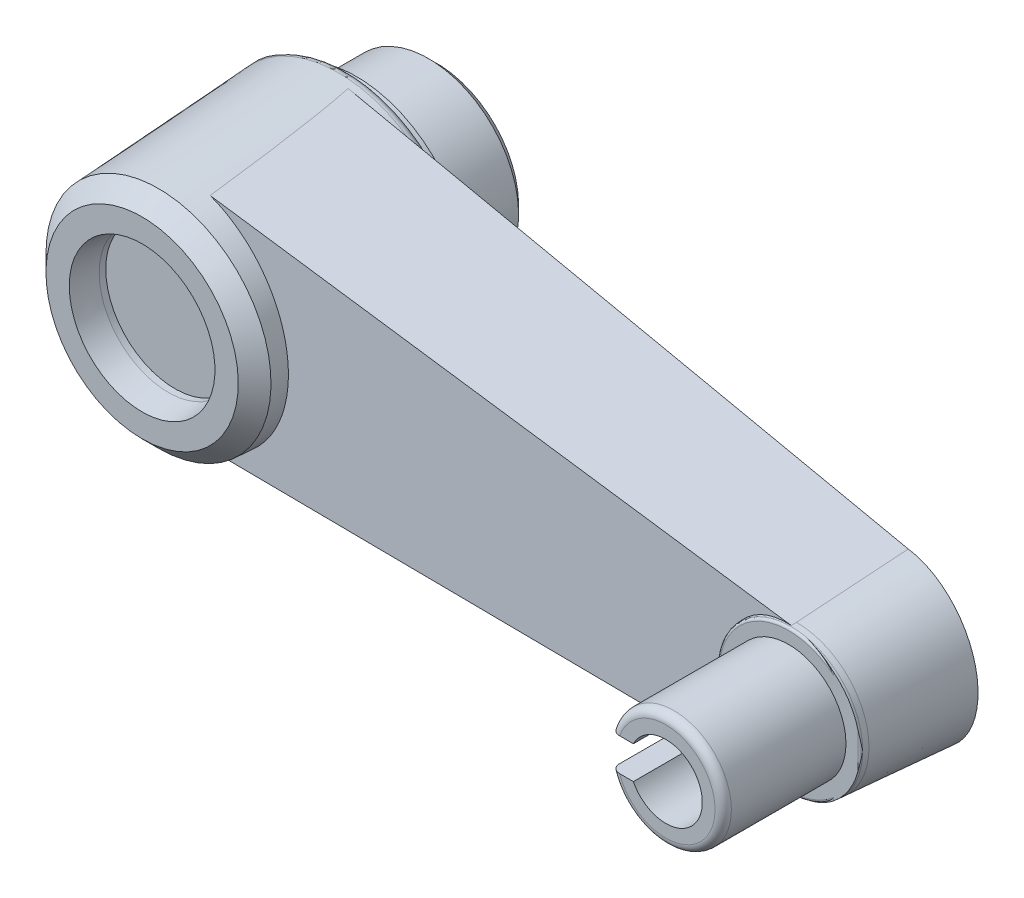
ISO-10303-21;
HEADER;
FILE_DESCRIPTION(('STEP AP214'),'2;1');
FILE_NAME('part.step','',(''),(''),'','','');
FILE_SCHEMA(('AUTOMOTIVE_DESIGN { 1 0 10303 214 1 1 1 1 }'));
ENDSEC;
DATA;
#1=APPLICATION_CONTEXT('core data for automotive mechanical design processes');
#2=APPLICATION_PROTOCOL_DEFINITION('international standard','automotive_design',2000,#1);
#3=PRODUCT_CONTEXT('',#1,'mechanical');
#4=PRODUCT('Part','Part','',(#3));
#5=PRODUCT_RELATED_PRODUCT_CATEGORY('part','',(#4));
#6=PRODUCT_DEFINITION_FORMATION('','',#4);
#7=PRODUCT_DEFINITION_CONTEXT('part definition',#1,'design');
#8=PRODUCT_DEFINITION('design','',#6,#7);
#9=PRODUCT_DEFINITION_SHAPE('','',#8);
#10=(LENGTH_UNIT() NAMED_UNIT(*) SI_UNIT(.MILLI.,.METRE.));
#11=(NAMED_UNIT(*) PLANE_ANGLE_UNIT() SI_UNIT($,.RADIAN.));
#12=(NAMED_UNIT(*) SI_UNIT($,.STERADIAN.) SOLID_ANGLE_UNIT());
#13=UNCERTAINTY_MEASURE_WITH_UNIT(LENGTH_MEASURE(1.E-05),#10,'distance_accuracy_value','');
#14=(GEOMETRIC_REPRESENTATION_CONTEXT(3) GLOBAL_UNCERTAINTY_ASSIGNED_CONTEXT((#13)) GLOBAL_UNIT_ASSIGNED_CONTEXT((#10,
#11,#12)) REPRESENTATION_CONTEXT('',''));
#15=CARTESIAN_POINT('',(0.,0.,0.));
#16=DIRECTION('',(0.,0.,1.));
#17=DIRECTION('',(1.,0.,0.));
#18=AXIS2_PLACEMENT_3D('',#15,#16,#17);
#19=CARTESIAN_POINT('',(80.,0.,43.));
#20=DIRECTION('',(0.,0.,1.));
#21=DIRECTION('',(0.,-1.,0.));
#22=AXIS2_PLACEMENT_3D('',#19,#20,#21);
#23=CYLINDRICAL_SURFACE('',#22,4.45);
#24=CARTESIAN_POINT('',(78.5,4.18957038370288,45.5));
#25=CARTESIAN_POINT('',(78.499999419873,4.18956994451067,45.4183565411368));
#26=CARTESIAN_POINT('',(78.5066881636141,4.19198297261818,45.3367169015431));
#27=CARTESIAN_POINT('',(78.53317354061,4.20132276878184,45.1758600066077));
#28=CARTESIAN_POINT('',(78.5529720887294,4.20825019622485,45.0966431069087));
#29=CARTESIAN_POINT('',(78.6048996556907,4.2257468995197,44.9429887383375));
#30=CARTESIAN_POINT('',(78.6370040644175,4.23630890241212,44.8685420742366));
#31=CARTESIAN_POINT('',(78.7125476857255,4.25987400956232,44.7260668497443));
#32=CARTESIAN_POINT('',(78.7559894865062,4.27287767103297,44.6580397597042));
#33=CARTESIAN_POINT('',(78.8548370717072,4.30044450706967,44.5276122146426));
#34=CARTESIAN_POINT('',(78.9106202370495,4.3150471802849,44.465506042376));
#35=CARTESIAN_POINT('',(79.0317620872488,4.34383320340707,44.3513289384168));
#36=CARTESIAN_POINT('',(79.0971223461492,4.35801648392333,44.2992596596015));
#37=CARTESIAN_POINT('',(79.2377220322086,4.38482400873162,44.2052921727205));
#38=CARTESIAN_POINT('',(79.3131789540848,4.39739640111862,44.1637032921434));
#39=CARTESIAN_POINT('',(79.4705143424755,4.41909938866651,44.0939258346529));
#40=CARTESIAN_POINT('',(79.5523910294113,4.42823093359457,44.0657335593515));
#41=CARTESIAN_POINT('',(79.7171555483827,4.44174352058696,44.0245504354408));
#42=CARTESIAN_POINT('',(79.7999041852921,4.44628176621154,44.0110552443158));
#43=CARTESIAN_POINT('',(79.9666075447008,4.45065496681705,43.9980446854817));
#44=CARTESIAN_POINT('',(80.050561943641,4.45049116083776,43.9985256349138));
#45=CARTESIAN_POINT('',(80.2137200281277,4.44558468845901,44.0131360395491));
#46=CARTESIAN_POINT('',(80.2929792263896,4.44102587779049,44.0267174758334));
#47=CARTESIAN_POINT('',(80.4480194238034,4.42807334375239,44.0662357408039));
#48=CARTESIAN_POINT('',(80.5238001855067,4.41967935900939,44.092173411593));
#49=CARTESIAN_POINT('',(80.6709184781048,4.3997678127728,44.1559820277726));
#50=CARTESIAN_POINT('',(80.7421835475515,4.38821020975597,44.1940070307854));
#51=CARTESIAN_POINT('',(80.8774817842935,4.36317163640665,44.2807832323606));
#52=CARTESIAN_POINT('',(80.9415129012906,4.34969012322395,44.3295374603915));
#53=CARTESIAN_POINT('',(81.0637833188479,4.32145721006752,44.4391396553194));
#54=CARTESIAN_POINT('',(81.1215961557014,4.30667591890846,44.5004563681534));
#55=CARTESIAN_POINT('',(81.2262584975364,4.27805346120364,44.632037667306));
#56=CARTESIAN_POINT('',(81.2731062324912,4.26421244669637,44.7023036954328));
#57=CARTESIAN_POINT('',(81.3551171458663,4.23887184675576,44.8511682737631));
#58=CARTESIAN_POINT('',(81.390096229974,4.22741013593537,44.929875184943));
#59=CARTESIAN_POINT('',(81.4461582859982,4.20856404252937,45.0925460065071));
#60=CARTESIAN_POINT('',(81.4672472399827,4.20117790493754,45.1765076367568));
#61=CARTESIAN_POINT('',(81.4940535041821,4.19171779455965,45.3431658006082));
#62=CARTESIAN_POINT('',(81.5004334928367,4.18941501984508,45.4257427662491));
#63=CARTESIAN_POINT('',(81.4995208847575,4.18974208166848,45.5908021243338));
#64=CARTESIAN_POINT('',(81.4922308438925,4.19237099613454,45.6732845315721));
#65=CARTESIAN_POINT('',(81.46478108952,4.20203674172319,45.8327674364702));
#66=CARTESIAN_POINT('',(81.4450861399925,4.20891422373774,45.9098586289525));
#67=CARTESIAN_POINT('',(81.3939456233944,4.22612570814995,46.0596250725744));
#68=CARTESIAN_POINT('',(81.362497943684,4.23646033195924,46.1322995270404));
#69=CARTESIAN_POINT('',(81.2875925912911,4.25983423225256,46.2737682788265));
#70=CARTESIAN_POINT('',(81.2437802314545,4.27294999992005,46.3423617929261));
#71=CARTESIAN_POINT('',(81.1457889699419,4.30026171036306,46.4714626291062));
#72=CARTESIAN_POINT('',(81.0916069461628,4.3144579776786,46.5319675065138));
#73=CARTESIAN_POINT('',(80.9712382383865,4.34317899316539,46.6462623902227));
#74=CARTESIAN_POINT('',(80.9045908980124,4.35768534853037,46.699573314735));
#75=CARTESIAN_POINT('',(80.7629391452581,4.38470240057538,46.7942878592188));
#76=CARTESIAN_POINT('',(80.6879350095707,4.39721316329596,46.8356918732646));
#77=CARTESIAN_POINT('',(80.5320508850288,4.4187742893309,46.9050442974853));
#78=CARTESIAN_POINT('',(80.4512119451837,4.42784646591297,46.9330778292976));
#79=CARTESIAN_POINT('',(80.2856000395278,4.4416015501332,46.9750329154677));
#80=CARTESIAN_POINT('',(80.200828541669,4.44628608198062,46.9889596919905));
#81=CARTESIAN_POINT('',(80.0341351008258,4.45061272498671,47.0018276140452));
#82=CARTESIAN_POINT('',(79.9522716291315,4.45048602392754,47.0014558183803));
#83=CARTESIAN_POINT('',(79.7898278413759,4.44577652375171,46.9874381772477));
#84=CARTESIAN_POINT('',(79.7092474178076,4.44119409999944,46.9737934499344));
#85=CARTESIAN_POINT('',(79.5529875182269,4.42817477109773,46.9340759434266));
#86=CARTESIAN_POINT('',(79.4772490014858,4.4198029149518,46.9082125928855));
#87=CARTESIAN_POINT('',(79.3311587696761,4.40006715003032,46.8449869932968));
#88=CARTESIAN_POINT('',(79.2608080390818,4.38870269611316,46.8076226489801));
#89=CARTESIAN_POINT('',(79.1246156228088,4.3636198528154,46.7208456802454));
#90=CARTESIAN_POINT('',(79.0590416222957,4.3498292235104,46.6710341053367));
#91=CARTESIAN_POINT('',(78.9369596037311,4.32161753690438,46.561450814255));
#92=CARTESIAN_POINT('',(78.8804545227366,4.307196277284,46.5016758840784));
#93=CARTESIAN_POINT('',(78.7757977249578,4.27865554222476,46.3709845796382));
#94=CARTESIAN_POINT('',(78.7280742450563,4.26457163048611,46.2997163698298));
#95=CARTESIAN_POINT('',(78.6453116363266,4.23900986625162,46.1497312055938));
#96=CARTESIAN_POINT('',(78.6102695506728,4.22753140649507,46.0710159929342));
#97=CARTESIAN_POINT('',(78.5551349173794,4.20900040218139,45.911368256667));
#98=CARTESIAN_POINT('',(78.5345285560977,4.20179730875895,45.8306312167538));
#99=CARTESIAN_POINT('',(78.5069638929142,4.19208338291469,45.6665941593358));
#100=CARTESIAN_POINT('',(78.5000005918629,4.18957083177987,45.5832950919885));
#101=CARTESIAN_POINT('',(78.5,4.18957038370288,45.5));
#102=B_SPLINE_CURVE_WITH_KNOTS('',3,(#24,#25,#26,#27,#28,#29,#30,#31,#32,#33,#34,#35,#36,#37,
#38,#39,#40,#41,#42,#43,#44,#45,#46,#47,#48,#49,#50,#51,#52,#53,#54,#55,#56,#57,#58,#59,#60,#61,
#62,#63,#64,#65,#66,#67,#68,#69,#70,#71,#72,#73,#74,#75,#76,#77,#78,#79,#80,#81,#82,#83,#84,#85,
#86,#87,#88,#89,#90,#91,#92,#93,#94,#95,#96,#97,#98,#99,#100,#101),.UNSPECIFIED.,.T.,.F.,(4,2,2,
2,2,2,2,2,2,2,2,2,2,2,2,2,2,2,2,2,2,2,2,2,2,2,2,2,2,2,2,2,2,2,2,2,2,2,4),(0.,0.244621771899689,
0.489279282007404,0.733450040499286,0.977676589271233,1.23077774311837,1.4839205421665,
1.74383476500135,2.00367719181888,2.25429085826,2.50483848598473,2.74534024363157,
2.98585839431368,3.2295740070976,3.47335852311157,3.72886365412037,3.98441000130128,
4.24375605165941,4.50299033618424,4.75029584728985,4.99755512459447,5.23606064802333,
5.47460906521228,5.72085239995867,5.96716999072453,6.22565010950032,6.48412167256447,
6.74092498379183,6.99763319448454,7.24202249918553,7.48639121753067,7.72671549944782,
7.96708358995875,8.2164572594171,8.46591152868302,8.72541546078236,8.98485884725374,
9.23452077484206,9.48409120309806),.UNSPECIFIED.);
#103=CARTESIAN_POINT('',(78.5,4.18957038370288,45.5));
#104=VERTEX_POINT('',#103);
#105=EDGE_CURVE('E27',#104,#104,#102,.T.);
#106=ORIENTED_EDGE('',*,*,#105,.F.);
#107=EDGE_LOOP('',(#106));
#108=FACE_BOUND('',#107,.T.);
#109=CARTESIAN_POINT('',(80.,0.,43.));
#110=DIRECTION('',(0.,0.,1.));
#111=DIRECTION('',(0.,-1.,0.));
#112=AXIS2_PLACEMENT_3D('',#109,#110,#111);
#113=CIRCLE('',#112,4.45);
#114=CARTESIAN_POINT('',(76.0247640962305,-1.99999987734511,43.));
#115=VERTEX_POINT('',#114);
#116=CARTESIAN_POINT('',(76.0247642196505,2.00000012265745,43.));
#117=VERTEX_POINT('',#116);
#118=EDGE_CURVE('E172',#115,#117,#113,.T.);
#119=ORIENTED_EDGE('',*,*,#118,.F.);
#120=DIRECTION('',(0.,0.,1.));
#121=VECTOR('',#120,1.);
#122=CARTESIAN_POINT('',(76.0247640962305,-1.99999987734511,43.));
#123=LINE('',#122,#121);
#124=CARTESIAN_POINT('',(76.0247640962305,-1.99999987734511,52.));
#125=VERTEX_POINT('',#124);
#126=EDGE_CURVE('E151',#115,#125,#123,.T.);
#127=ORIENTED_EDGE('',*,*,#126,.T.);
#128=CARTESIAN_POINT('',(80.,0.,52.));
#129=DIRECTION('',(0.,0.,1.));
#130=DIRECTION('',(0.,-1.,0.));
#131=AXIS2_PLACEMENT_3D('',#128,#129,#130);
#132=CIRCLE('',#131,4.45);
#133=CARTESIAN_POINT('',(76.0247642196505,2.00000012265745,52.));
#134=VERTEX_POINT('',#133);
#135=EDGE_CURVE('E145',#125,#134,#132,.T.);
#136=ORIENTED_EDGE('',*,*,#135,.T.);
#137=DIRECTION('',(0.,0.,1.));
#138=VECTOR('',#137,1.);
#139=CARTESIAN_POINT('',(76.0247642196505,2.00000012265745,43.));
#140=LINE('',#139,#138);
#141=EDGE_CURVE('E149',#117,#134,#140,.T.);
#142=ORIENTED_EDGE('',*,*,#141,.F.);
#143=EDGE_LOOP('',(#119,#127,#136,#142));
#144=FACE_BOUND('',#143,.T.);
#145=CARTESIAN_POINT('',(80.,-4.45,44.));
#146=CARTESIAN_POINT('',(79.9182073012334,-4.45000036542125,43.9999994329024));
#147=CARTESIAN_POINT('',(79.8364183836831,-4.4477242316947,44.0067117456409));
#148=CARTESIAN_POINT('',(79.6752527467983,-4.43886875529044,44.03329924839));
#149=CARTESIAN_POINT('',(79.5958762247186,-4.43228906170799,44.0531755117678));
#150=CARTESIAN_POINT('',(79.4418821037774,-4.4155406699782,44.1053299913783));
#151=CARTESIAN_POINT('',(79.3672566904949,-4.40537805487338,44.1375871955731));
#152=CARTESIAN_POINT('',(79.2244755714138,-4.38249893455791,44.2134918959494));
#153=CARTESIAN_POINT('',(79.1563211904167,-4.36978190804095,44.2571417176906));
#154=CARTESIAN_POINT('',(79.0260095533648,-4.34262780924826,44.3562110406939));
#155=CARTESIAN_POINT('',(78.9641123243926,-4.32814886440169,44.4119610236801));
#156=CARTESIAN_POINT('',(78.8503462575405,-4.29933099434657,44.5329456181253));
#157=CARTESIAN_POINT('',(78.7984796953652,-4.2849921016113,44.5981823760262));
#158=CARTESIAN_POINT('',(78.7047488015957,-4.2576149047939,44.7386465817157));
#159=CARTESIAN_POINT('',(78.6632249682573,-4.24462749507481,44.8141121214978));
#160=CARTESIAN_POINT('',(78.5935699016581,-4.22206168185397,44.9714638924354));
#161=CARTESIAN_POINT('',(78.5654344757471,-4.21248221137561,45.0533481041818));
#162=CARTESIAN_POINT('',(78.5243347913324,-4.19825838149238,45.2182523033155));
#163=CARTESIAN_POINT('',(78.5108824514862,-4.1934557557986,45.3011365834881));
#164=CARTESIAN_POINT('',(78.4980049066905,-4.18886165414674,45.4681142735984));
#165=CARTESIAN_POINT('',(78.4985752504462,-4.18906858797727,45.5522072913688));
#166=CARTESIAN_POINT('',(78.5133484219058,-4.19433171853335,45.7150281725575));
#167=CARTESIAN_POINT('',(78.5269110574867,-4.19916018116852,45.7938227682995));
#168=CARTESIAN_POINT('',(78.5662382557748,-4.21274917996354,45.9479447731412));
#169=CARTESIAN_POINT('',(78.5920043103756,-4.2215101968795,46.0232717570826));
#170=CARTESIAN_POINT('',(78.6554200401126,-4.2421372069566,46.1697617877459));
#171=CARTESIAN_POINT('',(78.6932573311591,-4.25405167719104,46.240836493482));
#172=CARTESIAN_POINT('',(78.7796112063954,-4.27962318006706,46.3758287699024));
#173=CARTESIAN_POINT('',(78.8281309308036,-4.29328072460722,46.4397442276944));
#174=CARTESIAN_POINT('',(78.9375345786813,-4.3216921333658,46.5621966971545));
#175=CARTESIAN_POINT('',(78.9989408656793,-4.33646557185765,46.620263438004));
#176=CARTESIAN_POINT('',(79.1308006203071,-4.36480635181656,46.725399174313));
#177=CARTESIAN_POINT('',(79.2012549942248,-4.37837357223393,46.7724670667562));
#178=CARTESIAN_POINT('',(79.3502255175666,-4.40295842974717,46.8546591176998));
#179=CARTESIAN_POINT('',(79.4288175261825,-4.41394823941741,46.8896546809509));
#180=CARTESIAN_POINT('',(79.5912324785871,-4.43193769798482,46.9457814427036));
#181=CARTESIAN_POINT('',(79.6750535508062,-4.43893876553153,46.9669175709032));
#182=CARTESIAN_POINT('',(79.8415680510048,-4.44792566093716,46.9938863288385));
#183=CARTESIAN_POINT('',(79.9241474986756,-4.45011953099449,47.000354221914));
#184=CARTESIAN_POINT('',(80.089229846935,-4.4498704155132,46.9996159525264));
#185=CARTESIAN_POINT('',(80.1717327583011,-4.44742823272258,46.9924121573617));
#186=CARTESIAN_POINT('',(80.33176028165,-4.43831878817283,46.9650361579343));
#187=CARTESIAN_POINT('',(80.4093599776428,-4.43177937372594,46.9452561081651));
#188=CARTESIAN_POINT('',(80.5601063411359,-4.41526166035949,46.8937815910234));
#189=CARTESIAN_POINT('',(80.6332524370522,-4.40528292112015,46.8620855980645));
#190=CARTESIAN_POINT('',(80.7751871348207,-4.38256674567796,46.786744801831));
#191=CARTESIAN_POINT('',(80.8438078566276,-4.36976293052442,46.7428043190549));
#192=CARTESIAN_POINT('',(80.9729071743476,-4.34284554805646,46.6445679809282));
#193=CARTESIAN_POINT('',(81.0333832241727,-4.32873157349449,46.5902689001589));
#194=CARTESIAN_POINT('',(81.1474056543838,-4.2999512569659,46.4698703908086));
#195=CARTESIAN_POINT('',(81.2004988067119,-4.28528976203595,46.4033395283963));
#196=CARTESIAN_POINT('',(81.2948259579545,-4.25773981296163,46.2619995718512));
#197=CARTESIAN_POINT('',(81.3360597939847,-4.24485138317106,46.1871903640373));
#198=CARTESIAN_POINT('',(81.4053218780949,-4.22242837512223,46.0313442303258));
#199=CARTESIAN_POINT('',(81.4333713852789,-4.21288840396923,45.9503175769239));
#200=CARTESIAN_POINT('',(81.4752960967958,-4.19839291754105,45.7842935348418));
#201=CARTESIAN_POINT('',(81.4891778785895,-4.19343527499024,45.6992980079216));
#202=CARTESIAN_POINT('',(81.5018530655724,-4.1889113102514,45.532550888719));
#203=CARTESIAN_POINT('',(81.5014004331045,-4.18907557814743,45.4508632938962));
#204=CARTESIAN_POINT('',(81.4872817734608,-4.19410870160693,45.2887933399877));
#205=CARTESIAN_POINT('',(81.4736165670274,-4.1989772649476,45.2084109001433));
#206=CARTESIAN_POINT('',(81.4339993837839,-4.2126676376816,45.0528253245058));
#207=CARTESIAN_POINT('',(81.4082969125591,-4.22140898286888,44.9775510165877));
#208=CARTESIAN_POINT('',(81.3455382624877,-4.24182868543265,44.8323263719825));
#209=CARTESIAN_POINT('',(81.3084795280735,-4.25350770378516,44.7623772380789));
#210=CARTESIAN_POINT('',(81.2221392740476,-4.27913384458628,44.6264180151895));
#211=CARTESIAN_POINT('',(81.1723877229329,-4.29315870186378,44.5607211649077));
#212=CARTESIAN_POINT('',(81.0628628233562,-4.32157605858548,44.4383652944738));
#213=CARTESIAN_POINT('',(81.0030866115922,-4.33596866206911,44.3817088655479));
#214=CARTESIAN_POINT('',(80.8723250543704,-4.36419440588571,44.2767442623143));
#215=CARTESIAN_POINT('',(80.800985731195,-4.37798180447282,44.2288631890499));
#216=CARTESIAN_POINT('',(80.6508138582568,-4.40280847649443,44.1458219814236));
#217=CARTESIAN_POINT('',(80.5719830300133,-4.41384837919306,44.1106589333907));
#218=CARTESIAN_POINT('',(80.4120739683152,-4.43158215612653,44.0553258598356));
#219=CARTESIAN_POINT('',(80.3311886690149,-4.43842253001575,44.0346463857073));
#220=CARTESIAN_POINT('',(80.1668671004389,-4.44763061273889,44.0069857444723));
#221=CARTESIAN_POINT('',(80.0834315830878,-4.44999962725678,44.0000005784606));
#222=CARTESIAN_POINT('',(80.,-4.45,44.));
#223=B_SPLINE_CURVE_WITH_KNOTS('',3,(#145,#146,#147,#148,#149,#150,#151,#152,#153,#154,#155,
#156,#157,#158,#159,#160,#161,#162,#163,#164,#165,#166,#167,#168,#169,#170,#171,#172,#173,#174,
#175,#176,#177,#178,#179,#180,#181,#182,#183,#184,#185,#186,#187,#188,#189,#190,#191,#192,#193,
#194,#195,#196,#197,#198,#199,#200,#201,#202,#203,#204,#205,#206,#207,#208,#209,#210,#211,#212,
#213,#214,#215,#216,#217,#218,#219,#220,#221,#222),.UNSPECIFIED.,.T.,.F.,(4,2,2,2,2,2,2,2,2,2,2,
2,2,2,2,2,2,2,2,2,2,2,2,2,2,2,2,2,2,2,2,2,2,2,2,2,2,2,4),(0.,0.245071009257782,
0.490162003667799,0.734838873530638,0.979565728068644,1.23208432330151,1.48466014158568,
1.7446926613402,2.00464369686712,2.25566248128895,2.50660158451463,2.74577945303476,
2.98498656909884,3.22810919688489,3.47130338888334,3.72750014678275,3.98372258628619,
4.24259565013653,4.50137658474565,4.74871668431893,4.9960139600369,5.23595472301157,
5.47592621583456,5.72228721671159,5.96872505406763,6.22662684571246,6.4845321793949,
6.74202021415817,6.99938865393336,7.24324366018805,7.48708351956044,7.72607880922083,
7.96512792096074,8.21480141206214,8.46454633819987,8.72432989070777,8.98405388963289,
9.23410842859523,9.48408993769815),.UNSPECIFIED.);
#224=CARTESIAN_POINT('',(80.,-4.45,44.));
#225=VERTEX_POINT('',#224);
#226=EDGE_CURVE('E9',#225,#225,#223,.T.);
#227=ORIENTED_EDGE('',*,*,#226,.F.);
#228=EDGE_LOOP('',(#227));
#229=FACE_BOUND('',#228,.T.);
#230=ADVANCED_FACE('F14',(#108,#144,#229),#23,.F.);
#231=CARTESIAN_POINT('',(80.,0.,52.));
#232=DIRECTION('',(0.,0.,1.));
#233=DIRECTION('',(0.,-1.,0.));
#234=AXIS2_PLACEMENT_3D('',#231,#232,#233);
#235=PLANE('',#234);
#236=ORIENTED_EDGE('',*,*,#135,.F.);
#237=DIRECTION('',(-1.,3.08554674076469E-08,0.));
#238=VECTOR('',#237,1.);
#239=CARTESIAN_POINT('',(76.0247640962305,-1.99999987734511,52.));
#240=LINE('',#239,#238);
#241=CARTESIAN_POINT('',(74.3431456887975,-1.99999982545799,52.));
#242=VERTEX_POINT('',#241);
#243=EDGE_CURVE('E170',#125,#242,#240,.T.);
#244=ORIENTED_EDGE('',*,*,#243,.T.);
#245=CARTESIAN_POINT('',(80.,0.,52.));
#246=DIRECTION('',(0.,0.,1.));
#247=DIRECTION('',(0.,-1.,0.));
#248=AXIS2_PLACEMENT_3D('',#245,#246,#247);
#249=CIRCLE('',#248,6.);
#250=CARTESIAN_POINT('',(74.343145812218,2.00000017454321,52.));
#251=VERTEX_POINT('',#250);
#252=EDGE_CURVE('E169',#242,#251,#249,.T.);
#253=ORIENTED_EDGE('',*,*,#252,.T.);
#254=DIRECTION('',(-1.,3.08546586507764E-08,0.));
#255=VECTOR('',#254,1.);
#256=CARTESIAN_POINT('',(76.0247642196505,2.00000012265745,52.));
#257=LINE('',#256,#255);
#258=EDGE_CURVE('E156',#134,#251,#257,.T.);
#259=ORIENTED_EDGE('',*,*,#258,.F.);
#260=EDGE_LOOP('',(#236,#244,#253,#259));
#261=FACE_BOUND('',#260,.T.);
#262=ADVANCED_FACE('F167',(#261),#235,.T.);
#263=CARTESIAN_POINT('',(80.,0.,51.));
#264=DIRECTION('',(0.,0.,1.));
#265=DIRECTION('',(0.,-1.,0.));
#266=AXIS2_PLACEMENT_3D('',#263,#264,#265);
#267=TOROIDAL_SURFACE('',#266,6.,1.00000000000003);
#268=ORIENTED_EDGE('',*,*,#252,.F.);
#269=CARTESIAN_POINT('',(73.418316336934,-1.99999979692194,51.4771006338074));
#270=CARTESIAN_POINT('',(73.3915148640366,-1.99999979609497,51.429859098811));
#271=CARTESIAN_POINT('',(73.3686164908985,-1.99999979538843,51.3803655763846));
#272=CARTESIAN_POINT('',(73.3314095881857,-1.9999997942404,51.2782096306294));
#273=CARTESIAN_POINT('',(73.3171084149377,-1.99999979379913,51.2255445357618));
#274=CARTESIAN_POINT('',(73.2976036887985,-1.9999997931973,51.1185351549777));
#275=CARTESIAN_POINT('',(73.2924024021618,-1.99999979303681,51.0641904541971));
#276=CARTESIAN_POINT('',(73.2912899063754,-1.99999979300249,50.9554170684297));
#277=CARTESIAN_POINT('',(73.295376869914,-1.99999979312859,50.900988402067));
#278=CARTESIAN_POINT('',(73.3126190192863,-1.99999979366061,50.7940644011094));
#279=CARTESIAN_POINT('',(73.3256971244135,-1.99999979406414,50.7415565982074));
#280=CARTESIAN_POINT('',(73.3603979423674,-1.99999979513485,50.6394488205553));
#281=CARTESIAN_POINT('',(73.3820209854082,-1.99999979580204,50.589848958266));
#282=CARTESIAN_POINT('',(73.4333647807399,-1.99999979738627,50.4943904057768));
#283=CARTESIAN_POINT('',(73.4631653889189,-1.99999979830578,50.4485747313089));
#284=CARTESIAN_POINT('',(73.5298185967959,-1.9999998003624,50.3624050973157));
#285=CARTESIAN_POINT('',(73.5666720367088,-1.99999980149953,50.3220517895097));
#286=CARTESIAN_POINT('',(73.6475732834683,-1.99999980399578,50.2465781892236));
#287=CARTESIAN_POINT('',(73.6918092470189,-1.9999998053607,50.2116597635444));
#288=CARTESIAN_POINT('',(73.7853044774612,-1.99999980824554,50.1493720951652));
#289=CARTESIAN_POINT('',(73.8345647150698,-1.99999980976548,50.1220043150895));
#290=CARTESIAN_POINT('',(73.9390535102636,-1.99999981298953,50.0742824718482));
#291=CARTESIAN_POINT('',(73.9944505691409,-1.99999981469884,50.0542974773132));
#292=CARTESIAN_POINT('',(74.1077265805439,-1.99999981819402,50.0234499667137));
#293=CARTESIAN_POINT('',(74.1656061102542,-1.99999981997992,50.0125895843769));
#294=CARTESIAN_POINT('',(74.2850740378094,-1.99999982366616,49.9998113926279));
#295=CARTESIAN_POINT('',(74.3467096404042,-1.99999982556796,49.9983335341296));
#296=CARTESIAN_POINT('',(74.4694062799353,-1.99999982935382,50.0054105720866));
#297=CARTESIAN_POINT('',(74.5304671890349,-1.99999983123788,50.0139676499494));
#298=CARTESIAN_POINT('',(74.6522593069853,-1.99999983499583,50.0412834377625));
#299=CARTESIAN_POINT('',(74.7129218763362,-1.9999998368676,50.0603495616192));
#300=CARTESIAN_POINT('',(74.8301773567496,-1.99999984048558,50.1084425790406));
#301=CARTESIAN_POINT('',(74.8867698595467,-1.99999984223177,50.1374704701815));
#302=CARTESIAN_POINT('',(74.9938177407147,-1.99999984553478,50.2046720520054));
#303=CARTESIAN_POINT('',(75.0443054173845,-1.9999998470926,50.2427941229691));
#304=CARTESIAN_POINT('',(75.137716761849,-1.99999984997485,50.3274106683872));
#305=CARTESIAN_POINT('',(75.1806425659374,-1.99999985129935,50.3739027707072));
#306=CARTESIAN_POINT('',(75.2550892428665,-1.99999985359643,50.4713652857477));
#307=CARTESIAN_POINT('',(75.2870981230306,-1.99999985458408,50.5219620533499));
#308=CARTESIAN_POINT('',(75.3412965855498,-1.9999998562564,50.6281671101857));
#309=CARTESIAN_POINT('',(75.3634924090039,-1.99999985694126,50.6837721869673));
#310=CARTESIAN_POINT('',(75.3955852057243,-1.9999998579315,50.7935842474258));
#311=CARTESIAN_POINT('',(75.4063266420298,-1.99999985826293,50.8475449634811));
#312=CARTESIAN_POINT('',(75.4180247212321,-1.99999985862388,50.9565110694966));
#313=CARTESIAN_POINT('',(75.4189850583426,-1.99999985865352,51.0115160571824));
#314=CARTESIAN_POINT('',(75.4112945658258,-1.99999985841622,51.1178716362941));
#315=CARTESIAN_POINT('',(75.403155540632,-1.99999985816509,51.1692602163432));
#316=CARTESIAN_POINT('',(75.3784454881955,-1.99999985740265,51.2699605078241));
#317=CARTESIAN_POINT('',(75.3618743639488,-1.99999985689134,51.319272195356));
#318=CARTESIAN_POINT('',(75.3207700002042,-1.99999985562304,51.4150372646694));
#319=CARTESIAN_POINT('',(75.2961574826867,-1.99999985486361,51.4614564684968));
#320=CARTESIAN_POINT('',(75.2399291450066,-1.99999985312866,51.549830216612));
#321=CARTESIAN_POINT('',(75.2083116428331,-1.99999985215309,51.5917836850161));
#322=CARTESIAN_POINT('',(75.1369125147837,-1.99999984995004,51.6728578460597));
#323=CARTESIAN_POINT('',(75.0967441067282,-1.99999984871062,51.7116375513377));
#324=CARTESIAN_POINT('',(75.0108715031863,-1.99999984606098,51.7824815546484));
#325=CARTESIAN_POINT('',(74.9651654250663,-1.99999984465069,51.8145435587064));
#326=CARTESIAN_POINT('',(74.8658042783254,-1.99999984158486,51.8735480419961));
#327=CARTESIAN_POINT('',(74.811809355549,-1.99999983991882,51.8999189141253));
#328=CARTESIAN_POINT('',(74.7003072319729,-1.99999983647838,51.9437281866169));
#329=CARTESIAN_POINT('',(74.6427990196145,-1.99999983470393,51.9611640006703));
#330=CARTESIAN_POINT('',(74.5227672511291,-1.9999998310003,51.9873799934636));
#331=CARTESIAN_POINT('',(74.4601372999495,-1.99999982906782,51.9956757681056));
#332=CARTESIAN_POINT('',(74.3343649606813,-1.99999982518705,52.001723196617));
#333=CARTESIAN_POINT('',(74.2712225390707,-1.99999982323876,51.9994741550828));
#334=CARTESIAN_POINT('',(74.1457791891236,-1.99999981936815,51.9843034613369));
#335=CARTESIAN_POINT('',(74.0834870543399,-1.9999998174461,51.9713083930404));
#336=CARTESIAN_POINT('',(73.9620743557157,-1.99999981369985,51.9347059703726));
#337=CARTESIAN_POINT('',(73.9029541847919,-1.99999981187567,51.9110973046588));
#338=CARTESIAN_POINT('',(73.7915684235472,-1.99999980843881,51.854623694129));
#339=CARTESIAN_POINT('',(73.7391490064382,-1.99999980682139,51.8220622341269));
#340=CARTESIAN_POINT('',(73.6409437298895,-1.99999980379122,51.7482012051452));
#341=CARTESIAN_POINT('',(73.5951475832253,-1.99999980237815,51.7069154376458));
#342=CARTESIAN_POINT('',(73.5275262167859,-1.99999980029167,51.6337758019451));
#343=CARTESIAN_POINT('',(73.5031682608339,-1.99999979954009,51.6042244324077));
#344=CARTESIAN_POINT('',(73.458000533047,-1.99999979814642,51.542521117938));
#345=CARTESIAN_POINT('',(73.4371905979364,-1.99999979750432,51.5103692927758));
#346=CARTESIAN_POINT('',(73.418316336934,-1.99999979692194,51.4771006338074));
#347=B_SPLINE_CURVE_WITH_KNOTS('',3,(#269,#270,#271,#272,#273,#274,#275,#276,#277,#278,#279,
#280,#281,#282,#283,#284,#285,#286,#287,#288,#289,#290,#291,#292,#293,#294,#295,#296,#297,#298,
#299,#300,#301,#302,#303,#304,#305,#306,#307,#308,#309,#310,#311,#312,#313,#314,#315,#316,#317,
#318,#319,#320,#321,#322,#323,#324,#325,#326,#327,#328,#329,#330,#331,#332,#333,#334,#335,#336,
#337,#338,#339,#340,#341,#342,#343,#344,#345,#346),.UNSPECIFIED.,.T.,.F.,(4,2,2,2,2,2,2,2,2,2,2,
2,2,2,2,2,2,2,2,2,2,2,2,2,2,2,2,2,2,2,2,2,2,2,2,2,2,2,4),(0.,0.162808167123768,
0.325755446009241,0.48874329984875,0.651699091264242,0.813275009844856,0.974857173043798,
1.13807711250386,1.30131650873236,1.46963454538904,1.63798516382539,1.81387657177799,
1.98980909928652,2.17393377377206,2.35809848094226,2.54796061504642,2.73784176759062,
2.9266697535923,3.11544430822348,3.29409979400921,3.47264149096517,3.63684657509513,
3.80098963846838,3.95634490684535,4.11170196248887,4.26863935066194,4.42561446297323,
4.59240164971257,4.75924569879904,4.9387253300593,5.11825688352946,5.30690351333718,
5.49556258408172,5.6855213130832,5.87550351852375,6.05970536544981,6.2436179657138,
6.35827678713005,6.472930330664),.UNSPECIFIED.);
#348=CARTESIAN_POINT('',(73.2917960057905,-1.9999997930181,51.));
#349=VERTEX_POINT('',#348);
#350=EDGE_CURVE('E187',#242,#349,#347,.T.);
#351=ORIENTED_EDGE('',*,*,#350,.T.);
#352=CARTESIAN_POINT('',(80.,0.,51.));
#353=DIRECTION('',(0.,0.,1.));
#354=DIRECTION('',(0.,-1.,0.));
#355=AXIS2_PLACEMENT_3D('',#352,#353,#354);
#356=CIRCLE('',#355,7.);
#357=CARTESIAN_POINT('',(73.291796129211,2.00000020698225,51.));
#358=VERTEX_POINT('',#357);
#359=EDGE_CURVE('E374',#349,#358,#356,.T.);
#360=ORIENTED_EDGE('',*,*,#359,.T.);
#361=CARTESIAN_POINT('',(73.4183164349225,2.00000020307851,51.477100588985));
#362=CARTESIAN_POINT('',(73.3915149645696,2.00000020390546,51.4298590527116));
#363=CARTESIAN_POINT('',(73.3686165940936,2.00000020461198,51.3803655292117));
#364=CARTESIAN_POINT('',(73.3314096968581,2.00000020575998,51.2782095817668));
#365=CARTESIAN_POINT('',(73.3171085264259,2.00000020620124,51.225544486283));
#366=CARTESIAN_POINT('',(73.2976038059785,2.00000020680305,51.1185351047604));
#367=CARTESIAN_POINT('',(73.2924025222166,2.00000020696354,51.0641904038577));
#368=CARTESIAN_POINT('',(73.2912900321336,2.00000020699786,50.9554170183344));
#369=CARTESIAN_POINT('',(73.2953769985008,2.00000020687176,50.9009883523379));
#370=CARTESIAN_POINT('',(73.3126191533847,2.00000020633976,50.7940643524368));
#371=CARTESIAN_POINT('',(73.3256972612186,2.00000020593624,50.7415565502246));
#372=CARTESIAN_POINT('',(73.3603980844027,2.00000020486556,50.6394487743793));
#373=CARTESIAN_POINT('',(73.382021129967,2.00000020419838,50.589848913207));
#374=CARTESIAN_POINT('',(73.433364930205,2.00000020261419,50.4943903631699));
#375=CARTESIAN_POINT('',(73.4631655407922,2.0000002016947,50.4485746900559));
#376=CARTESIAN_POINT('',(73.5298187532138,2.00000019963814,50.3624050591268));
#377=CARTESIAN_POINT('',(73.5666721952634,2.00000019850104,50.3220517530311));
#378=CARTESIAN_POINT('',(73.6475734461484,2.00000019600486,50.2465781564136));
#379=CARTESIAN_POINT('',(73.6918094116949,2.00000019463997,50.2116597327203));
#380=CARTESIAN_POINT('',(73.7853046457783,2.00000019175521,50.1493720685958));
#381=CARTESIAN_POINT('',(73.8345648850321,2.0000001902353,50.1220042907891));
#382=CARTESIAN_POINT('',(73.9390536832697,2.00000018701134,50.0742824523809));
#383=CARTESIAN_POINT('',(73.9944507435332,2.00000018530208,50.0542974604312));
#384=CARTESIAN_POINT('',(74.107726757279,2.00000018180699,50.0234499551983));
#385=CARTESIAN_POINT('',(74.165606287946,2.00000018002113,50.0125895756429));
#386=CARTESIAN_POINT('',(74.2850742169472,2.00000017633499,49.9998113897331));
#387=CARTESIAN_POINT('',(74.3467098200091,2.00000017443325,49.9983335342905));
#388=CARTESIAN_POINT('',(74.4694064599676,2.00000017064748,50.0054105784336));
#389=CARTESIAN_POINT('',(74.5304673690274,2.00000016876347,50.0139676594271));
#390=CARTESIAN_POINT('',(74.6522594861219,2.00000016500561,50.0412834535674));
#391=CARTESIAN_POINT('',(74.7129220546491,2.00000016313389,50.0603495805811));
#392=CARTESIAN_POINT('',(74.8301775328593,2.00000015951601,50.1084426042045));
#393=CARTESIAN_POINT('',(74.886770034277,2.00000015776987,50.1374704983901));
#394=CARTESIAN_POINT('',(74.9938179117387,2.00000015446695,50.2046720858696));
#395=CARTESIAN_POINT('',(75.0443055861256,2.00000015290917,50.2427941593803));
#396=CARTESIAN_POINT('',(75.1377169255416,2.00000015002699,50.3274107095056));
#397=CARTESIAN_POINT('',(75.1806427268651,2.00000014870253,50.3739028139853));
#398=CARTESIAN_POINT('',(75.2550893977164,2.0000001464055,50.4713653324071));
#399=CARTESIAN_POINT('',(75.2870982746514,2.00000014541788,50.5219621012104));
#400=CARTESIAN_POINT('',(75.3412967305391,2.00000014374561,50.6281671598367));
#401=CARTESIAN_POINT('',(75.3634925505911,2.00000014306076,50.6837722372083));
#402=CARTESIAN_POINT('',(75.3955853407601,2.00000014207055,50.7935842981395));
#403=CARTESIAN_POINT('',(75.406326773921,2.00000014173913,50.8475450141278));
#404=CARTESIAN_POINT('',(75.4180248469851,2.00000014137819,50.9565111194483));
#405=CARTESIAN_POINT('',(75.4189851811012,2.00000014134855,51.0115161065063));
#406=CARTESIAN_POINT('',(75.4112946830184,2.00000014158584,51.1178716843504));
#407=CARTESIAN_POINT('',(75.4031556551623,2.00000014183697,51.16926026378));
#408=CARTESIAN_POINT('',(75.3784455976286,2.00000014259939,51.2699605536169));
#409=CARTESIAN_POINT('',(75.3618744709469,2.00000014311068,51.3192722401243));
#410=CARTESIAN_POINT('',(75.3207701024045,2.00000014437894,51.4150373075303));
#411=CARTESIAN_POINT('',(75.2961575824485,2.00000014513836,51.4614565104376));
#412=CARTESIAN_POINT('',(75.2399292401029,2.00000014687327,51.5498302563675));
#413=CARTESIAN_POINT('',(75.2083117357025,2.00000014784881,51.5917837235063));
#414=CARTESIAN_POINT('',(75.1369126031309,2.00000015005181,51.6728578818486));
#415=CARTESIAN_POINT('',(75.0967441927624,2.00000015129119,51.7116375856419));
#416=CARTESIAN_POINT('',(75.0108715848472,2.00000015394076,51.7824815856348));
#417=CARTESIAN_POINT('',(74.965165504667,2.000000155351,51.8145435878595));
#418=CARTESIAN_POINT('',(74.8658043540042,2.00000015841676,51.8735480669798));
#419=CARTESIAN_POINT('',(74.8118094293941,2.00000016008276,51.8999189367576));
#420=CARTESIAN_POINT('',(74.700307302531,2.00000016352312,51.9437282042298));
#421=CARTESIAN_POINT('',(74.6427990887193,2.00000016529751,51.9611640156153));
#422=CARTESIAN_POINT('',(74.5227673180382,2.00000016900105,51.9873800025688));
#423=CARTESIAN_POINT('',(74.460137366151,2.00000017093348,51.995675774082));
#424=CARTESIAN_POINT('',(74.3343650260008,2.00000017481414,52.001723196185));
#425=CARTESIAN_POINT('',(74.2712226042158,2.00000017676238,51.9994741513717));
#426=CARTESIAN_POINT('',(74.1457792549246,2.00000018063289,51.9843034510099));
#427=CARTESIAN_POINT('',(74.0834871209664,2.00000018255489,51.9713083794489));
#428=CARTESIAN_POINT('',(73.9620744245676,2.00000018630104,51.9347059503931));
#429=CARTESIAN_POINT('',(73.9029542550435,2.00000018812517,51.9110972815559));
#430=CARTESIAN_POINT('',(73.791568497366,2.00000019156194,51.8546236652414));
#431=CARTESIAN_POINT('',(73.7391490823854,2.00000019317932,51.8220622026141));
#432=CARTESIAN_POINT('',(73.640943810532,2.00000019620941,51.7482011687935));
#433=CARTESIAN_POINT('',(73.5951476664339,2.00000019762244,51.70691539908));
#434=CARTESIAN_POINT('',(73.5275263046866,2.00000019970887,51.6337757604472));
#435=CARTESIAN_POINT('',(73.503168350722,2.00000020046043,51.6042243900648));
#436=CARTESIAN_POINT('',(73.4580006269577,2.00000020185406,51.5425210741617));
#437=CARTESIAN_POINT('',(73.4371906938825,2.00000020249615,51.5103692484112));
#438=CARTESIAN_POINT('',(73.4183164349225,2.00000020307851,51.477100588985));
#439=B_SPLINE_CURVE_WITH_KNOTS('',3,(#361,#362,#363,#364,#365,#366,#367,#368,#369,#370,#371,
#372,#373,#374,#375,#376,#377,#378,#379,#380,#381,#382,#383,#384,#385,#386,#387,#388,#389,#390,
#391,#392,#393,#394,#395,#396,#397,#398,#399,#400,#401,#402,#403,#404,#405,#406,#407,#408,#409,
#410,#411,#412,#413,#414,#415,#416,#417,#418,#419,#420,#421,#422,#423,#424,#425,#426,#427,#428,
#429,#430,#431,#432,#433,#434,#435,#436,#437,#438),.UNSPECIFIED.,.T.,.F.,(4,2,2,2,2,2,2,2,2,2,2,
2,2,2,2,2,2,2,2,2,2,2,2,2,2,2,2,2,2,2,2,2,2,2,2,2,2,2,4),(0.,0.162808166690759,0.32575544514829,
0.488743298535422,0.651699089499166,0.81327500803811,0.974857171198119,1.13807711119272,
1.30131650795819,1.46963454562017,1.63798516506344,1.81387657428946,1.98980910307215,
2.17393377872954,2.35809848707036,2.54796062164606,2.7378417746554,2.92666975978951,
3.11544431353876,3.29409979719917,3.47264149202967,3.6368465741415,3.80098963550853,
3.95634490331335,4.11170195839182,4.26863934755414,4.42561446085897,4.5924016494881,
4.7592457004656,4.9387253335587,5.11825688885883,5.30690351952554,5.49556259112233,
5.685521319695,5.87550352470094,6.05970537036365,6.24361796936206,6.35827678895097,
6.47293033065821),.UNSPECIFIED.);
#440=EDGE_CURVE('E180',#251,#358,#439,.T.);
#441=ORIENTED_EDGE('',*,*,#440,.F.);
#442=EDGE_LOOP('',(#268,#351,#360,#441));
#443=FACE_BOUND('',#442,.T.);
#444=ADVANCED_FACE('F193',(#443),#267,.T.);
#445=CARTESIAN_POINT('',(80.,0.,91.645997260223));
#446=DIRECTION('',(0.,0.,1.));
#447=DIRECTION('',(0.,-1.,0.));
#448=AXIS2_PLACEMENT_3D('',#445,#446,#447);
#449=CYLINDRICAL_SURFACE('',#448,7.);
#450=CARTESIAN_POINT('',(80.,0.,37.));
#451=DIRECTION('',(0.,0.,1.));
#452=DIRECTION('',(0.,-1.,0.));
#453=AXIS2_PLACEMENT_3D('',#450,#451,#452);
#454=CIRCLE('',#453,7.);
#455=CARTESIAN_POINT('',(80.,-7.,37.));
#456=VERTEX_POINT('',#455);
#457=EDGE_CURVE('E375',#456,#456,#454,.T.);
#458=ORIENTED_EDGE('',*,*,#457,.T.);
#459=EDGE_LOOP('',(#458));
#460=FACE_BOUND('',#459,.T.);
#461=DIRECTION('',(0.,0.,1.));
#462=VECTOR('',#461,1.);
#463=CARTESIAN_POINT('',(73.2917960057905,-1.9999997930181,91.645997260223));
#464=LINE('',#463,#462);
#465=CARTESIAN_POINT('',(73.2917960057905,-1.9999997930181,43.));
#466=VERTEX_POINT('',#465);
#467=EDGE_CURVE('E352',#466,#349,#464,.T.);
#468=ORIENTED_EDGE('',*,*,#467,.F.);
#469=CARTESIAN_POINT('',(80.,0.,43.));
#470=DIRECTION('',(0.,0.,1.));
#471=DIRECTION('',(0.,-1.,0.));
#472=AXIS2_PLACEMENT_3D('',#469,#470,#471);
#473=CIRCLE('',#472,7.);
#474=CARTESIAN_POINT('',(73.291796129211,2.00000020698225,43.));
#475=VERTEX_POINT('',#474);
#476=EDGE_CURVE('E368',#475,#466,#473,.T.);
#477=ORIENTED_EDGE('',*,*,#476,.F.);
#478=DIRECTION('',(0.,0.,1.));
#479=VECTOR('',#478,1.);
#480=CARTESIAN_POINT('',(73.291796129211,2.00000020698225,91.645997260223));
#481=LINE('',#480,#479);
#482=EDGE_CURVE('E353',#475,#358,#481,.T.);
#483=ORIENTED_EDGE('',*,*,#482,.T.);
#484=ORIENTED_EDGE('',*,*,#359,.F.);
#485=EDGE_LOOP('',(#468,#477,#483,#484));
#486=FACE_BOUND('',#485,.T.);
#487=ADVANCED_FACE('F327',(#460,#486),#449,.T.);
#488=CARTESIAN_POINT('',(-11.75,0.,36.));
#489=DIRECTION('',(0.,0.,-1.));
#490=DIRECTION('',(0.,1.,0.));
#491=AXIS2_PLACEMENT_3D('',#488,#489,#490);
#492=PLANE('',#491);
#493=CARTESIAN_POINT('',(0.,0.,36.));
#494=DIRECTION('',(0.,0.,1.));
#495=DIRECTION('',(0.,-1.,0.));
#496=AXIS2_PLACEMENT_3D('',#493,#494,#495);
#497=CIRCLE('',#496,11.75);
#498=CARTESIAN_POINT('',(0.,-11.75,36.));
#499=VERTEX_POINT('',#498);
#500=EDGE_CURVE('E466',#499,#499,#497,.T.);
#501=ORIENTED_EDGE('',*,*,#500,.T.);
#502=EDGE_LOOP('',(#501));
#503=FACE_BOUND('',#502,.T.);
#504=CARTESIAN_POINT('',(0.,0.,36.));
#505=DIRECTION('',(0.,0.,1.));
#506=DIRECTION('',(-1.,0.,0.));
#507=AXIS2_PLACEMENT_3D('',#504,#505,#506);
#508=CIRCLE('',#507,8.9);
#509=CARTESIAN_POINT('',(-8.9,0.,36.));
#510=VERTEX_POINT('',#509);
#511=EDGE_CURVE('E494',#510,#510,#508,.T.);
#512=ORIENTED_EDGE('',*,*,#511,.F.);
#513=EDGE_LOOP('',(#512));
#514=FACE_BOUND('',#513,.T.);
#515=ADVANCED_FACE('F330',(#503,#514),#492,.F.);
#516=CARTESIAN_POINT('',(-15.0687067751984,-15.,10.8092395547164));
#517=DIRECTION('',(-0.120714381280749,0.,0.992687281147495));
#518=DIRECTION('',(-0.992687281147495,0.,-0.120714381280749));
#519=AXIS2_PLACEMENT_3D('',#516,#517,#518);
#520=PLANE('',#519);
#521=DIRECTION('',(0.990651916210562,0.0640040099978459,0.120466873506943));
#522=VECTOR('',#521,1.);
#523=CARTESIAN_POINT('',(-15.010758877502,-15.9101787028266,10.8162862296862));
#524=LINE('',#523,#522);
#525=CARTESIAN_POINT('',(2.06479268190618,-14.8069619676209,12.8927353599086));
#526=VERTEX_POINT('',#525);
#527=CARTESIAN_POINT('',(79.9778004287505,-9.77316064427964,22.3672402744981));
#528=VERTEX_POINT('',#527);
#529=EDGE_CURVE('E445',#526,#528,#524,.T.);
#530=ORIENTED_EDGE('',*,*,#529,.F.);
#531=CARTESIAN_POINT('',(-0.103481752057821,0.,12.6290653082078));
#532=DIRECTION('',(-0.120714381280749,0.,0.992687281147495));
#533=DIRECTION('',(-0.992687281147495,0.,-0.120714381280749));
#534=AXIS2_PLACEMENT_3D('',#531,#532,#533);
#535=ELLIPSE('',#534,15.0754697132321,14.9648692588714);
#536=CARTESIAN_POINT('',(2.06479268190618,14.8069619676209,12.8927353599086));
#537=VERTEX_POINT('',#536);
#538=EDGE_CURVE('E455',#526,#537,#535,.T.);
#539=ORIENTED_EDGE('',*,*,#538,.T.);
#540=DIRECTION('',(-0.990651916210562,0.0640040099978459,-0.120466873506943));
#541=VECTOR('',#540,1.);
#542=CARTESIAN_POINT('',(-13.1085880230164,15.7872833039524,11.0475971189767));
#543=LINE('',#542,#541);
#544=CARTESIAN_POINT('',(79.9778004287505,9.77316064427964,22.3672402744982));
#545=VERTEX_POINT('',#544);
#546=EDGE_CURVE('E530',#545,#537,#543,.T.);
#547=ORIENTED_EDGE('',*,*,#546,.F.);
#548=CARTESIAN_POINT('',(79.916890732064,0.,22.3598334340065));
#549=DIRECTION('',(-0.120714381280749,0.,0.992687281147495));
#550=DIRECTION('',(-0.992687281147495,0.,-0.120714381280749));
#551=AXIS2_PLACEMENT_3D('',#548,#549,#550);
#552=ELLIPSE('',#551,9.84570264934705,9.7733504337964);
#553=EDGE_CURVE('E458',#545,#528,#552,.F.);
#554=ORIENTED_EDGE('',*,*,#553,.T.);
#555=EDGE_LOOP('',(#530,#539,#547,#554));
#556=FACE_BOUND('',#555,.T.);
#557=ADVANCED_FACE('F287',(#556),#520,.F.);
#558=CARTESIAN_POINT('',(80.,0.,10.8092395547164));
#559=DIRECTION('',(0.,0.,-1.));
#560=DIRECTION('',(0.,-1.,0.));
#561=AXIS2_PLACEMENT_3D('',#558,#559,#560);
#562=CONICAL_SURFACE('',#561,10.5814,0.0698131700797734);
#563=CARTESIAN_POINT('',(79.957082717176,0.,36.6137482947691));
#564=DIRECTION('',(-0.0697564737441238,0.,0.997564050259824));
#565=DIRECTION('',(-0.997564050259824,0.,-0.0697564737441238));
#566=AXIS2_PLACEMENT_3D('',#563,#564,#565);
#567=ELLIPSE('',#566,8.7984054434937,8.77686804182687);
#568=CARTESIAN_POINT('',(85.4807394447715,-6.82080336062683,37.));
#569=VERTEX_POINT('',#568);
#570=CARTESIAN_POINT('',(81.556340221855,-8.6299391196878,36.725579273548));
#571=VERTEX_POINT('',#570);
#572=EDGE_CURVE('E546',#569,#571,#567,.F.);
#573=ORIENTED_EDGE('',*,*,#572,.T.);
#574=CARTESIAN_POINT('',(80.,0.,36.7255792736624));
#575=DIRECTION('',(0.,0.,-1.));
#576=DIRECTION('',(0.,1.,0.));
#577=AXIS2_PLACEMENT_3D('',#574,#575,#576);
#578=CIRCLE('',#577,8.76915298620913);
#579=CARTESIAN_POINT('',(88.7691529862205,2.30624795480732E-12,36.7255792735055));
#580=VERTEX_POINT('',#579);
#581=EDGE_CURVE('E573',#571,#580,#578,.F.);
#582=ORIENTED_EDGE('',*,*,#581,.T.);
#583=CARTESIAN_POINT('',(88.4700454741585,-2.19549381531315,36.9999999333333));
#584=CARTESIAN_POINT('',(88.4826218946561,-2.1469758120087,37.000000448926));
#585=CARTESIAN_POINT('',(88.4948313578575,-2.09837083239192,36.9992267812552));
#586=CARTESIAN_POINT('',(88.518494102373,-2.00102788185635,36.9963360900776));
#587=CARTESIAN_POINT('',(88.5299475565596,-1.95228994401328,36.9942193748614));
#588=CARTESIAN_POINT('',(88.5631544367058,-1.80588036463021,36.9861600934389));
#589=CARTESIAN_POINT('',(88.5837481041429,-1.70803712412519,36.9785085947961));
#590=CARTESIAN_POINT('',(88.6196088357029,-1.52314279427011,36.960849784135));
#591=CARTESIAN_POINT('',(88.6352147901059,-1.43612062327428,36.9512060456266));
#592=CARTESIAN_POINT('',(88.6638979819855,-1.2619136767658,36.929824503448));
#593=CARTESIAN_POINT('',(88.6769749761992,-1.17472888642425,36.9180864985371));
#594=CARTESIAN_POINT('',(88.712366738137,-0.913155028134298,36.8804423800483));
#595=CARTESIAN_POINT('',(88.7308737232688,-0.73858454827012,36.8520888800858));
#596=CARTESIAN_POINT('',(88.7504376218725,-0.482782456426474,36.8083063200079));
#597=CARTESIAN_POINT('',(88.7555322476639,-0.401617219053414,36.7940849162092));
#598=CARTESIAN_POINT('',(88.7635257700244,-0.239076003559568,36.7648492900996));
#599=CARTESIAN_POINT('',(88.7664182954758,-0.157700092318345,36.7498329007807));
#600=CARTESIAN_POINT('',(88.7683797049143,-0.063471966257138,36.7334830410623));
#601=CARTESIAN_POINT('',(88.7686145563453,-0.0508005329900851,36.7313060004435));
#602=CARTESIAN_POINT('',(88.768903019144,-0.0317718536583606,36.7283636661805));
#603=CARTESIAN_POINT('',(88.7689884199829,-0.0254392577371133,36.7274384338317));
#604=CARTESIAN_POINT('',(88.7691114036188,-0.0127214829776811,36.726074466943));
#605=CARTESIAN_POINT('',(88.7691491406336,-0.00633654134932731,36.7256341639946));
#606=CARTESIAN_POINT('',(88.7691663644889,0.0221990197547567,36.7253883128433));
#607=CARTESIAN_POINT('',(88.7687694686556,0.0441899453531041,36.7298629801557));
#608=CARTESIAN_POINT('',(88.7678603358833,0.0883946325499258,36.7380985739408));
#609=CARTESIAN_POINT('',(88.767346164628,0.110605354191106,36.7418453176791));
#610=CARTESIAN_POINT('',(88.7661037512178,0.155864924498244,36.7498027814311));
#611=CARTESIAN_POINT('',(88.7653683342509,0.178914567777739,36.754025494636));
#612=CARTESIAN_POINT('',(88.7637259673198,0.224888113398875,36.7623621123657));
#613=CARTESIAN_POINT('',(88.7628198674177,0.247812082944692,36.7664764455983));
#614=CARTESIAN_POINT('',(88.7579461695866,0.360033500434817,36.7865737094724));
#615=CARTESIAN_POINT('',(88.7527106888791,0.449322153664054,36.8024278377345));
#616=CARTESIAN_POINT('',(88.7395462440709,0.628011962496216,36.8332717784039));
#617=CARTESIAN_POINT('',(88.7316122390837,0.717413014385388,36.8482599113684));
#618=CARTESIAN_POINT('',(88.7131549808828,0.895243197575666,36.8768638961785));
#619=CARTESIAN_POINT('',(88.7026584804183,0.98367308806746,36.8904919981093));
#620=CARTESIAN_POINT('',(88.679055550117,1.16038623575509,36.9161063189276));
#621=CARTESIAN_POINT('',(88.6659502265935,1.24866953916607,36.928093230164));
#622=CARTESIAN_POINT('',(88.6398468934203,1.4085302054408,36.9478930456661));
#623=CARTESIAN_POINT('',(88.62728992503,1.48013475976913,36.9560671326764));
#624=CARTESIAN_POINT('',(88.6004796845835,1.62320142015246,36.9706880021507));
#625=CARTESIAN_POINT('',(88.5862264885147,1.69466353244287,36.977134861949));
#626=CARTESIAN_POINT('',(88.5559528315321,1.83784237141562,36.9879508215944));
#627=CARTESIAN_POINT('',(88.5399219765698,1.90955793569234,36.9923068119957));
#628=CARTESIAN_POINT('',(88.5062089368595,2.05274121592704,36.9983201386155));
#629=CARTESIAN_POINT('',(88.4885260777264,2.12420881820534,36.9999763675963));
#630=CARTESIAN_POINT('',(88.4700454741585,2.19549381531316,36.9999999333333));
#631=B_SPLINE_CURVE_WITH_KNOTS('',3,(#583,#584,#585,#586,#587,#588,#589,#590,#591,#592,#593,
#594,#595,#596,#597,#598,#599,#600,#601,#602,#603,#604,#605,#606,#607,#608,#609,#610,#611,#612,
#613,#614,#615,#616,#617,#618,#619,#620,#621,#622,#623,#624,#625,#626,#627,#628,#629,#630),
.UNSPECIFIED.,.F.,.F.,(4,2,2,2,2,2,2,2,2,2,2,2,2,2,2,2,2,2,2,2,2,2,2,4),(0.,0.150344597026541,
0.300654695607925,0.601349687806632,0.86809083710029,1.13485763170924,1.66789473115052,
1.9155504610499,2.16392001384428,2.20249337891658,2.22169617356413,2.24083667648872,
2.30743193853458,2.37521720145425,2.44549439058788,2.5154304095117,2.78786666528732,
3.06081465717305,3.33102652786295,3.60112405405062,3.8205542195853,4.03997455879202,
4.26075322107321,4.48162240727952),.UNSPECIFIED.);
#632=CARTESIAN_POINT('',(88.4702454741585,-2.19472206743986,37.));
#633=VERTEX_POINT('',#632);
#634=EDGE_CURVE('E538',#633,#580,#631,.T.);
#635=ORIENTED_EDGE('',*,*,#634,.F.);
#636=CARTESIAN_POINT('',(80.,0.,37.));
#637=DIRECTION('',(0.,0.,-1.));
#638=DIRECTION('',(0.,1.,0.));
#639=AXIS2_PLACEMENT_3D('',#636,#637,#638);
#640=CIRCLE('',#639,8.74996361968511);
#641=EDGE_CURVE('E420',#569,#633,#640,.F.);
#642=ORIENTED_EDGE('',*,*,#641,.F.);
#643=EDGE_LOOP('',(#573,#582,#635,#642));
#644=FACE_BOUND('',#643,.T.);
#645=ADVANCED_FACE('F440',(#644),#562,.T.);
#646=CARTESIAN_POINT('',(88.4702454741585,2.19472206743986,37.));
#647=VERTEX_POINT('',#646);
#648=EDGE_CURVE('E545',#580,#647,#631,.T.);
#649=ORIENTED_EDGE('',*,*,#648,.F.);
#650=CARTESIAN_POINT('',(81.556340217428,8.62993912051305,36.7255792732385));
#651=VERTEX_POINT('',#650);
#652=EDGE_CURVE('E421',#580,#651,#578,.F.);
#653=ORIENTED_EDGE('',*,*,#652,.T.);
#654=CARTESIAN_POINT('',(85.4807394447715,6.82080336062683,37.));
#655=VERTEX_POINT('',#654);
#656=EDGE_CURVE('E548',#651,#655,#567,.F.);
#657=ORIENTED_EDGE('',*,*,#656,.T.);
#658=EDGE_CURVE('E429',#647,#655,#640,.F.);
#659=ORIENTED_EDGE('',*,*,#658,.F.);
#660=EDGE_LOOP('',(#649,#653,#657,#659));
#661=FACE_BOUND('',#660,.T.);
#662=ADVANCED_FACE('F441',(#661),#562,.T.);
#663=CARTESIAN_POINT('',(88.4702454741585,-15.,37.));
#664=DIRECTION('',(0.,0.,-1.));
#665=DIRECTION('',(1.,0.,0.));
#666=AXIS2_PLACEMENT_3D('',#663,#664,#665);
#667=PLANE('',#666);
#668=DIRECTION('',(0.,1.,0.));
#669=VECTOR('',#668,1.);
#670=CARTESIAN_POINT('',(85.4807394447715,-15.,37.));
#671=LINE('',#670,#669);
#672=CARTESIAN_POINT('',(85.4807394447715,6.45806112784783,37.));
#673=VERTEX_POINT('',#672);
#674=EDGE_CURVE('E536',#673,#655,#671,.T.);
#675=ORIENTED_EDGE('',*,*,#674,.F.);
#676=CARTESIAN_POINT('',(80.,0.,37.));
#677=DIRECTION('',(0.,0.,1.));
#678=DIRECTION('',(0.,-1.,0.));
#679=AXIS2_PLACEMENT_3D('',#676,#677,#678);
#680=CIRCLE('',#679,8.47024547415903);
#681=CARTESIAN_POINT('',(85.4807394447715,-6.45806112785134,37.));
#682=VERTEX_POINT('',#681);
#683=EDGE_CURVE('E379',#673,#682,#680,.T.);
#684=ORIENTED_EDGE('',*,*,#683,.T.);
#685=EDGE_CURVE('E534',#569,#682,#671,.T.);
#686=ORIENTED_EDGE('',*,*,#685,.F.);
#687=ORIENTED_EDGE('',*,*,#641,.T.);
#688=DIRECTION('',(0.,1.,0.));
#689=VECTOR('',#688,1.);
#690=CARTESIAN_POINT('',(88.4702454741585,-15.,37.));
#691=LINE('',#690,#689);
#692=EDGE_CURVE('E532',#633,#647,#691,.T.);
#693=ORIENTED_EDGE('',*,*,#692,.T.);
#694=ORIENTED_EDGE('',*,*,#658,.T.);
#695=EDGE_LOOP('',(#675,#684,#686,#687,#693,#694));
#696=FACE_BOUND('',#695,.T.);
#697=ORIENTED_EDGE('',*,*,#457,.F.);
#698=EDGE_LOOP('',(#697));
#699=FACE_BOUND('',#698,.T.);
#700=ADVANCED_FACE('F16',(#696,#699),#667,.F.);
#701=CARTESIAN_POINT('',(-13.9748730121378,-15.,30.0453860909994));
#702=DIRECTION('',(-0.0697564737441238,0.,0.997564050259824));
#703=DIRECTION('',(-0.997564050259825,0.,-0.0697564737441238));
#704=AXIS2_PLACEMENT_3D('',#701,#702,#703);
#705=PLANE('',#704);
#706=CARTESIAN_POINT('',(81.4869486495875,-8.64254683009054,36.7207269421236));
#707=CARTESIAN_POINT('',(81.585191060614,-8.62516080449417,36.7275967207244));
#708=CARTESIAN_POINT('',(81.6830871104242,-8.6058685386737,36.7344422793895));
#709=CARTESIAN_POINT('',(81.8782593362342,-8.56345249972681,36.7480900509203));
#710=CARTESIAN_POINT('',(81.9755338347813,-8.54032097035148,36.7548921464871));
#711=CARTESIAN_POINT('',(82.2687963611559,-8.46451725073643,36.7753990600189));
#712=CARTESIAN_POINT('',(82.4633028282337,-8.40595093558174,36.7890002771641));
#713=CARTESIAN_POINT('',(82.8471793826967,-8.27350389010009,36.8158435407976));
#714=CARTESIAN_POINT('',(83.0365460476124,-8.19961322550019,36.8290853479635));
#715=CARTESIAN_POINT('',(83.408761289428,-8.03679582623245,36.8551131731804));
#716=CARTESIAN_POINT('',(83.5916092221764,-7.94786761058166,36.867899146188));
#717=CARTESIAN_POINT('',(83.9492730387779,-7.7552350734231,36.8929094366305));
#718=CARTESIAN_POINT('',(84.1240947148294,-7.65154163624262,36.9051341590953));
#719=CARTESIAN_POINT('',(84.3781074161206,-7.48546579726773,36.9228964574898));
#720=CARTESIAN_POINT('',(84.4609829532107,-7.42868538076,36.9286916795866));
#721=CARTESIAN_POINT('',(84.6241039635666,-7.31137737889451,36.9400982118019));
#722=CARTESIAN_POINT('',(84.7043486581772,-7.25084869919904,36.9457094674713));
#723=CARTESIAN_POINT('',(84.8618034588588,-7.12581659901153,36.9567197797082));
#724=CARTESIAN_POINT('',(84.9390110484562,-7.06130999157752,36.9621186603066));
#725=CARTESIAN_POINT('',(85.0895579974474,-6.92798438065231,36.9726459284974));
#726=CARTESIAN_POINT('',(85.1629008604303,-6.85916941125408,36.9777745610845));
#727=CARTESIAN_POINT('',(85.2684655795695,-6.75154012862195,36.9851563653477));
#728=CARTESIAN_POINT('',(85.3029056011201,-6.71493720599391,36.987564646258));
#729=CARTESIAN_POINT('',(85.3526117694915,-6.65849198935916,36.9910404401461));
#730=CARTESIAN_POINT('',(85.368811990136,-6.63947575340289,36.9921732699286));
#731=CARTESIAN_POINT('',(85.4003094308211,-6.6007103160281,36.9943757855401));
#732=CARTESIAN_POINT('',(85.4156075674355,-6.58096189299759,36.9954455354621));
#733=CARTESIAN_POINT('',(85.4372120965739,-6.55040909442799,36.9969562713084));
#734=CARTESIAN_POINT('',(85.4441869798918,-6.54007467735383,36.9974440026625));
#735=CARTESIAN_POINT('',(85.4574919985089,-6.51881088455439,36.9983743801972));
#736=CARTESIAN_POINT('',(85.4638152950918,-6.50787674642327,36.9988165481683));
#737=CARTESIAN_POINT('',(85.4719934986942,-6.49075947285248,36.9993884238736));
#738=CARTESIAN_POINT('',(85.4745159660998,-6.48488644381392,36.9995648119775));
#739=CARTESIAN_POINT('',(85.478660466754,-6.47284839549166,36.9998546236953));
#740=CARTESIAN_POINT('',(85.4802987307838,-6.46669106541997,36.999969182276));
#741=CARTESIAN_POINT('',(85.48073746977,-6.45920635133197,36.9999998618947));
#742=CARTESIAN_POINT('',(85.4807607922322,-6.45798257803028,37.0000014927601));
#743=CARTESIAN_POINT('',(85.4806696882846,-6.45553717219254,36.9999951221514));
#744=CARTESIAN_POINT('',(85.4805550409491,-6.45431554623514,36.9999871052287));
#745=CARTESIAN_POINT('',(85.4801482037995,-6.45188262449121,36.9999586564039));
#746=CARTESIAN_POINT('',(85.4798535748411,-6.45067170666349,36.9999380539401));
#747=CARTESIAN_POINT('',(85.4790410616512,-6.4483278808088,36.9998812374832));
#748=CARTESIAN_POINT('',(85.4785239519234,-6.44719471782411,36.9998450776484));
#749=CARTESIAN_POINT('',(85.4774143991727,-6.44534631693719,36.9997674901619));
#750=CARTESIAN_POINT('',(85.476875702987,-6.44459862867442,36.999729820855));
#751=CARTESIAN_POINT('',(85.4756772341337,-6.44320800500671,36.9996460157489));
#752=CARTESIAN_POINT('',(85.4750174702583,-6.44256506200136,36.9995998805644));
#753=CARTESIAN_POINT('',(85.473604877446,-6.44140027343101,36.9995011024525));
#754=CARTESIAN_POINT('',(85.4728524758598,-6.44087790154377,36.9994484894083));
#755=CARTESIAN_POINT('',(85.4712803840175,-6.43994831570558,36.9993385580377));
#756=CARTESIAN_POINT('',(85.47046064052,-6.4395411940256,36.9992812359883));
#757=CARTESIAN_POINT('',(85.4681889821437,-6.4385813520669,36.9991223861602));
#758=CARTESIAN_POINT('',(85.4666963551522,-6.43812631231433,36.9990180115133));
#759=CARTESIAN_POINT('',(85.4636603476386,-6.43744315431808,36.9988057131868));
#760=CARTESIAN_POINT('',(85.4621168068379,-6.43721584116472,36.9986977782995));
#761=CARTESIAN_POINT('',(85.4564857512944,-6.43668140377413,36.9983040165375));
#762=CARTESIAN_POINT('',(85.4523590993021,-6.43684986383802,36.9980154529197));
#763=CARTESIAN_POINT('',(85.4441639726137,-6.43773053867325,36.9974423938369));
#764=CARTESIAN_POINT('',(85.4400961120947,-6.43844657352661,36.9971579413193));
#765=CARTESIAN_POINT('',(85.4195106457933,-6.44281552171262,36.9957184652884));
#766=CARTESIAN_POINT('',(85.4035083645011,-6.44868961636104,36.9945994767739));
#767=CARTESIAN_POINT('',(85.3720442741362,-6.4615462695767,36.992399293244));
#768=CARTESIAN_POINT('',(85.3565841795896,-6.46853201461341,36.99131821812));
#769=CARTESIAN_POINT('',(85.3110026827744,-6.49024837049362,36.9881308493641));
#770=CARTESIAN_POINT('',(85.2812873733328,-6.50588783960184,36.9860529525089));
#771=CARTESIAN_POINT('',(85.2222616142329,-6.53791447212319,36.9819254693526));
#772=CARTESIAN_POINT('',(85.192951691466,-6.55430250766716,36.9798759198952));
#773=CARTESIAN_POINT('',(85.1345993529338,-6.58740866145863,36.9757955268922));
#774=CARTESIAN_POINT('',(85.1055564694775,-6.60412591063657,36.9737646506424));
#775=CARTESIAN_POINT('',(85.0475588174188,-6.63767642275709,36.9697090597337));
#776=CARTESIAN_POINT('',(85.0186040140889,-6.65450962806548,36.9676843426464));
#777=CARTESIAN_POINT('',(84.9316861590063,-6.70504345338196,36.9616064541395));
#778=CARTESIAN_POINT('',(84.873723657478,-6.73874689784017,36.9575533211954));
#779=CARTESIAN_POINT('',(84.7575064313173,-6.80564285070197,36.9494266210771));
#780=CARTESIAN_POINT('',(84.6992517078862,-6.83883536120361,36.9453530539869));
#781=CARTESIAN_POINT('',(84.5238297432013,-6.9372650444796,36.9330863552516));
#782=CARTESIAN_POINT('',(84.4060121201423,-7.00134994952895,36.9248477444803));
#783=CARTESIAN_POINT('',(84.1682185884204,-7.12541032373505,36.9082196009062));
#784=CARTESIAN_POINT('',(84.0482424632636,-7.18538537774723,36.8998300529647));
#785=CARTESIAN_POINT('',(83.8060862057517,-7.30072762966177,36.8828968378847));
#786=CARTESIAN_POINT('',(83.6839057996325,-7.35609425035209,36.8743531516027));
#787=CARTESIAN_POINT('',(83.394875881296,-7.48013540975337,36.8541422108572));
#788=CARTESIAN_POINT('',(83.2271646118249,-7.54680704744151,36.8424146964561));
#789=CARTESIAN_POINT('',(82.8882840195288,-7.67065072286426,36.8187178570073));
#790=CARTESIAN_POINT('',(82.717114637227,-7.72782259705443,36.8067485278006));
#791=CARTESIAN_POINT('',(82.3708521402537,-7.83259197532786,36.7825354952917));
#792=CARTESIAN_POINT('',(82.1957426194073,-7.88013507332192,36.7702906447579));
#793=CARTESIAN_POINT('',(81.8430513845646,-7.96503279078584,36.745628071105));
#794=CARTESIAN_POINT('',(81.6654692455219,-8.00238563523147,36.7332103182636));
#795=CARTESIAN_POINT('',(81.4869486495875,-8.03452607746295,36.7207269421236));
#796=B_SPLINE_CURVE_WITH_KNOTS('',3,(#706,#707,#708,#709,#710,#711,#712,#713,#714,#715,#716,
#717,#718,#719,#720,#721,#722,#723,#724,#725,#726,#727,#728,#729,#730,#731,#732,#733,#734,#735,
#736,#737,#738,#739,#740,#741,#742,#743,#744,#745,#746,#747,#748,#749,#750,#751,#752,#753,#754,
#755,#756,#757,#758,#759,#760,#761,#762,#763,#764,#765,#766,#767,#768,#769,#770,#771,#772,#773,
#774,#775,#776,#777,#778,#779,#780,#781,#782,#783,#784,#785,#786,#787,#788,#789,#790,#791,#792,
#793,#794,#795),.UNSPECIFIED.,.F.,.F.,(4,2,2,2,2,2,2,2,2,2,2,2,2,2,2,2,2,2,2,2,2,2,2,2,2,2,2,2,
2,2,2,2,2,2,2,2,2,2,2,2,2,2,2,2,4),(0.,0.299975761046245,0.600565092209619,1.21063715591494,
1.82110595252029,2.43163490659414,3.04171611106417,3.34351747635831,3.64540737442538,
3.94754235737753,4.24939855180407,4.40026464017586,4.47527679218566,4.55021136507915,
4.58764485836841,4.62543801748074,4.64463166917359,4.66345985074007,4.66712537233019,
4.67079677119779,4.67451906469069,4.67822850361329,4.68098210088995,4.68373549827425,
4.68647663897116,4.68921996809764,4.69388433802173,4.69856514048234,4.71088787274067,
4.72329736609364,4.77419318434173,4.82523761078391,4.92606391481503,5.02701084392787,
5.12771983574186,5.22838194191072,5.42989386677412,5.63140496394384,6.03445308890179,
6.43754186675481,6.84068105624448,7.3829699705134,7.92526821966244,8.47055004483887,
9.01592679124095),.UNSPECIFIED.);
#797=EDGE_CURVE('E310',#571,#682,#796,.T.);
#798=ORIENTED_EDGE('',*,*,#797,.F.);
#799=ORIENTED_EDGE('',*,*,#572,.F.);
#800=ORIENTED_EDGE('',*,*,#685,.T.);
#801=EDGE_LOOP('',(#798,#799,#800));
#802=FACE_BOUND('',#801,.T.);
#803=ADVANCED_FACE('F298',(#802),#705,.T.);
#804=CARTESIAN_POINT('',(81.4869486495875,8.03452607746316,36.7207269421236));
#805=CARTESIAN_POINT('',(81.5851854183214,8.01682981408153,36.7275963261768));
#806=CARTESIAN_POINT('',(81.6831339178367,7.9975655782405,36.7344455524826));
#807=CARTESIAN_POINT('',(81.8784056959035,7.95591578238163,36.7481002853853));
#808=CARTESIAN_POINT('',(81.9757287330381,7.93352908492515,36.7549057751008));
#809=CARTESIAN_POINT('',(82.2669092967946,7.86164687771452,36.7752671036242));
#810=CARTESIAN_POINT('',(82.4596430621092,7.80748966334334,36.7887443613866));
#811=CARTESIAN_POINT('',(82.8412949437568,7.68713010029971,36.8154320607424));
#812=CARTESIAN_POINT('',(83.0302132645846,7.62092839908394,36.8286425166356));
#813=CARTESIAN_POINT('',(83.4111853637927,7.47408980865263,36.8552826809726));
#814=CARTESIAN_POINT('',(83.6030573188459,7.39297767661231,36.8686996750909));
#815=CARTESIAN_POINT('',(83.8935334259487,7.25966442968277,36.8890117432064));
#816=CARTESIAN_POINT('',(83.9940315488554,7.21155163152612,36.8960392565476));
#817=CARTESIAN_POINT('',(84.1935258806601,7.11228999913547,36.9099892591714));
#818=CARTESIAN_POINT('',(84.2925221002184,7.06114118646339,36.9169117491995));
#819=CARTESIAN_POINT('',(84.5033408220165,6.94853179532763,36.9316536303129));
#820=CARTESIAN_POINT('',(84.6149395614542,6.88665203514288,36.9394573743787));
#821=CARTESIAN_POINT('',(84.7813217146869,6.79202021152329,36.9510919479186));
#822=CARTESIAN_POINT('',(84.8366209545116,6.76016954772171,36.9549588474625));
#823=CARTESIAN_POINT('',(84.9470427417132,6.69616058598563,36.9626802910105));
#824=CARTESIAN_POINT('',(85.0021652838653,6.66400227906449,36.9665348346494));
#825=CARTESIAN_POINT('',(85.101009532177,6.60672192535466,36.9734466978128));
#826=CARTESIAN_POINT('',(85.1446955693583,6.58153986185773,36.9765015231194));
#827=CARTESIAN_POINT('',(85.2325567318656,6.5320917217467,36.9826453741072));
#828=CARTESIAN_POINT('',(85.2767316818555,6.5078253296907,36.9857343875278));
#829=CARTESIAN_POINT('',(85.3460802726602,6.47321592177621,36.9905837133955));
#830=CARTESIAN_POINT('',(85.3705761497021,6.4616305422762,36.9922966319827));
#831=CARTESIAN_POINT('',(85.4040325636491,6.44878965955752,36.9946361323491));
#832=CARTESIAN_POINT('',(85.412317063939,6.44584051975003,36.995215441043));
#833=CARTESIAN_POINT('',(85.4267971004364,6.44147849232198,36.996227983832));
#834=CARTESIAN_POINT('',(85.4329281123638,6.43986666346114,36.99665670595));
#835=CARTESIAN_POINT('',(85.442416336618,6.43804693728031,36.9973201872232));
#836=CARTESIAN_POINT('',(85.4457142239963,6.43753557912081,36.9975507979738));
#837=CARTESIAN_POINT('',(85.4523451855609,6.43688861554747,36.9980144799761));
#838=CARTESIAN_POINT('',(85.4556780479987,6.43675140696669,36.9982475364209));
#839=CARTESIAN_POINT('',(85.4602846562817,6.43702574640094,36.9985696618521));
#840=CARTESIAN_POINT('',(85.4615734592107,6.43715344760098,36.9986597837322));
#841=CARTESIAN_POINT('',(85.4641338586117,6.4375438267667,36.9988388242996));
#842=CARTESIAN_POINT('',(85.4654054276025,6.43780669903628,36.9989277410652));
#843=CARTESIAN_POINT('',(85.467920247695,6.43851128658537,36.9991035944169));
#844=CARTESIAN_POINT('',(85.4691628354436,6.43895550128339,36.9991904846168));
#845=CARTESIAN_POINT('',(85.4715434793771,6.44006780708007,36.9993569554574));
#846=CARTESIAN_POINT('',(85.4726819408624,6.44073497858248,36.9994365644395));
#847=CARTESIAN_POINT('',(85.4744625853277,6.44207638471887,36.9995610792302));
#848=CARTESIAN_POINT('',(85.47515123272,6.44268854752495,36.999609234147));
#849=CARTESIAN_POINT('',(85.4764129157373,6.44402291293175,36.9996974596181));
#850=CARTESIAN_POINT('',(85.4769859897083,6.4447450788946,36.9997375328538));
#851=CARTESIAN_POINT('',(85.477999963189,6.44627388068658,36.9998084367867));
#852=CARTESIAN_POINT('',(85.4784412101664,6.44708028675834,36.9998392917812));
#853=CARTESIAN_POINT('',(85.479195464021,6.44875099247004,36.9998920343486));
#854=CARTESIAN_POINT('',(85.479508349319,6.44961534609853,36.9999139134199));
#855=CARTESIAN_POINT('',(85.4801643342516,6.45187891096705,36.9999597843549));
#856=CARTESIAN_POINT('',(85.4804231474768,6.45330236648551,36.9999778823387));
#857=CARTESIAN_POINT('',(85.4807230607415,6.45617186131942,36.9999988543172));
#858=CARTESIAN_POINT('',(85.4807634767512,6.45761795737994,37.0000016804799));
#859=CARTESIAN_POINT('',(85.4806346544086,6.46256616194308,36.999992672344));
#860=CARTESIAN_POINT('',(85.4800834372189,6.4660542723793,36.9999541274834));
#861=CARTESIAN_POINT('',(85.4785079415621,6.47292140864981,36.999843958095));
#862=CARTESIAN_POINT('',(85.4774805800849,6.47629956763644,36.9997721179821));
#863=CARTESIAN_POINT('',(85.472152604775,6.49165209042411,36.9993995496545));
#864=CARTESIAN_POINT('',(85.46630564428,6.50305731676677,36.9989906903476));
#865=CARTESIAN_POINT('',(85.453630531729,6.52524537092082,36.9981043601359));
#866=CARTESIAN_POINT('',(85.4467988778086,6.53602577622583,36.9976266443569));
#867=CARTESIAN_POINT('',(85.4255763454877,6.56757639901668,36.9961426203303));
#868=CARTESIAN_POINT('',(85.410336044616,6.58778791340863,36.9950769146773));
#869=CARTESIAN_POINT('',(85.3788466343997,6.62740945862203,36.9928749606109));
#870=CARTESIAN_POINT('',(85.3625958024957,6.64681802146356,36.9917385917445));
#871=CARTESIAN_POINT('',(85.3294212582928,6.68501553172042,36.9894188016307));
#872=CARTESIAN_POINT('',(85.3124983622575,6.7038051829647,36.9882354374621));
#873=CARTESIAN_POINT('',(85.2781662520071,6.74089911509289,36.985834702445));
#874=CARTESIAN_POINT('',(85.260757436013,6.75920377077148,36.9846173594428));
#875=CARTESIAN_POINT('',(85.2078969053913,6.81355748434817,36.9809209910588));
#876=CARTESIAN_POINT('',(85.1718386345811,6.8490153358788,36.9783995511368));
#877=CARTESIAN_POINT('',(85.0985169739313,6.91865966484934,36.9732724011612));
#878=CARTESIAN_POINT('',(85.0612533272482,6.95284586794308,36.9706666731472));
#879=CARTESIAN_POINT('',(84.9479008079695,7.05377814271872,36.9627402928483));
#880=CARTESIAN_POINT('',(84.8703112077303,7.11883684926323,36.9573146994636));
#881=CARTESIAN_POINT('',(84.7118413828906,7.24510087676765,36.9462334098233));
#882=CARTESIAN_POINT('',(84.630954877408,7.30629821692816,36.9405772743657));
#883=CARTESIAN_POINT('',(84.4664916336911,7.42486489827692,36.9290768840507));
#884=CARTESIAN_POINT('',(84.3829158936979,7.48223563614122,36.9232326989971));
#885=CARTESIAN_POINT('',(84.1271725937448,7.64969752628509,36.9053493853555));
#886=CARTESIAN_POINT('',(83.9512757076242,7.75412472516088,36.8930494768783));
#887=CARTESIAN_POINT('',(83.5913497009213,7.94803894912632,36.867880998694));
#888=CARTESIAN_POINT('',(83.4073144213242,8.03751440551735,36.8550119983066));
#889=CARTESIAN_POINT('',(83.0328344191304,8.20114998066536,36.8288258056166));
#890=CARTESIAN_POINT('',(82.8423969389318,8.27532676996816,36.8155091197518));
#891=CARTESIAN_POINT('',(82.4563381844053,8.40817594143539,36.7885132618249));
#892=CARTESIAN_POINT('',(82.2607204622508,8.46685865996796,36.7748343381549));
#893=CARTESIAN_POINT('',(81.9678580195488,8.54217358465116,36.7543554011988));
#894=CARTESIAN_POINT('',(81.8721227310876,8.56484597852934,36.7476609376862));
#895=CARTESIAN_POINT('',(81.6800189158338,8.6064727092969,36.7342277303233));
#896=CARTESIAN_POINT('',(81.5836517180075,8.62543320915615,36.7274890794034));
#897=CARTESIAN_POINT('',(81.4869486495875,8.64254683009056,36.7207269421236));
#898=B_SPLINE_CURVE_WITH_KNOTS('',3,(#804,#805,#806,#807,#808,#809,#810,#811,#812,#813,#814,
#815,#816,#817,#818,#819,#820,#821,#822,#823,#824,#825,#826,#827,#828,#829,#830,#831,#832,#833,
#834,#835,#836,#837,#838,#839,#840,#841,#842,#843,#844,#845,#846,#847,#848,#849,#850,#851,#852,
#853,#854,#855,#856,#857,#858,#859,#860,#861,#862,#863,#864,#865,#866,#867,#868,#869,#870,#871,
#872,#873,#874,#875,#876,#877,#878,#879,#880,#881,#882,#883,#884,#885,#886,#887,#888,#889,#890,
#891,#892,#893,#894,#895,#896,#897),.UNSPECIFIED.,.F.,.F.,(4,2,2,2,2,2,2,2,2,2,2,2,2,2,2,2,2,2,
2,2,2,2,2,2,2,2,2,2,2,2,2,2,2,2,2,2,2,2,2,2,2,2,2,2,2,2,4),(0.,0.300135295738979,
0.600380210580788,1.20189242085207,1.80337230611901,2.42915945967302,2.76404345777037,
3.09892507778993,3.48241042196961,3.6742080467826,3.86601129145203,4.01755315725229,
4.16904233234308,4.25035310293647,4.27677234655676,4.29579493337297,4.30582205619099,
4.31580614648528,4.31969573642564,4.32359093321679,4.32754173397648,4.3314764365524,
4.33423162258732,4.33698589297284,4.33973283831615,4.34248237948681,4.34679791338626,
4.35112695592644,4.36164022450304,4.37222253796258,4.41041634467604,4.44874949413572,
4.52463266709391,4.60064893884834,4.67657555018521,4.75244166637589,4.90429817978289,
5.0561872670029,5.36022386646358,5.66486955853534,5.96940344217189,6.58337525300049,
7.19781993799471,7.81159149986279,8.42495256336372,8.72072370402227,9.01599952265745),.UNSPECIFIED.);
#899=EDGE_CURVE('E302',#673,#651,#898,.T.);
#900=ORIENTED_EDGE('',*,*,#899,.F.);
#901=ORIENTED_EDGE('',*,*,#674,.T.);
#902=ORIENTED_EDGE('',*,*,#656,.F.);
#903=EDGE_LOOP('',(#900,#901,#902));
#904=FACE_BOUND('',#903,.T.);
#905=ADVANCED_FACE('F299',(#904),#705,.T.);
#906=CARTESIAN_POINT('',(88.4702454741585,-15.,36.7));
#907=DIRECTION('',(0.,1.,0.));
#908=DIRECTION('',(-1.,0.,0.));
#909=AXIS2_PLACEMENT_3D('',#906,#907,#908);
#910=CYLINDRICAL_SURFACE('',#909,0.30000000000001);
#911=ORIENTED_EDGE('',*,*,#634,.T.);
#912=ORIENTED_EDGE('',*,*,#648,.T.);
#913=ORIENTED_EDGE('',*,*,#692,.F.);
#914=EDGE_LOOP('',(#911,#912,#913));
#915=FACE_BOUND('',#914,.T.);
#916=ADVANCED_FACE('F288',(#915),#910,.T.);
#917=CARTESIAN_POINT('',(80.,0.,36.7));
#918=DIRECTION('',(0.,0.,1.));
#919=DIRECTION('',(0.,-1.,0.));
#920=AXIS2_PLACEMENT_3D('',#917,#918,#919);
#921=TOROIDAL_SURFACE('',#920,8.47024547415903,0.3);
#922=CARTESIAN_POINT('',(80.,0.,36.7209269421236));
#923=DIRECTION('',(0.,0.,1.));
#924=DIRECTION('',(0.,-1.,0.));
#925=AXIS2_PLACEMENT_3D('',#922,#923,#924);
#926=CIRCLE('',#925,8.76951468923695);
#927=CARTESIAN_POINT('',(80.,-8.76951468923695,36.7209269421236));
#928=VERTEX_POINT('',#927);
#929=EDGE_CURVE('E557',#928,#928,#926,.T.);
#930=ORIENTED_EDGE('',*,*,#929,.T.);
#931=EDGE_LOOP('',(#930));
#932=FACE_BOUND('',#931,.T.);
#933=ORIENTED_EDGE('',*,*,#581,.F.);
#934=ORIENTED_EDGE('',*,*,#797,.T.);
#935=ORIENTED_EDGE('',*,*,#683,.F.);
#936=ORIENTED_EDGE('',*,*,#899,.T.);
#937=ORIENTED_EDGE('',*,*,#652,.F.);
#938=EDGE_LOOP('',(#933,#934,#935,#936,#937));
#939=FACE_BOUND('',#938,.T.);
#940=ADVANCED_FACE('F319',(#932,#939),#921,.T.);
#941=CARTESIAN_POINT('',(80.,0.,36.7209269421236));
#942=DIRECTION('',(0.,0.,-1.));
#943=DIRECTION('',(0.,1.,0.));
#944=AXIS2_PLACEMENT_3D('',#941,#942,#943);
#945=CONICAL_SURFACE('',#944,8.76951468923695,0.0698131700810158);
#946=CARTESIAN_POINT('',(79.95708253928,0.,36.6137482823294));
#947=DIRECTION('',(-0.0697564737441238,0.,0.997564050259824));
#948=DIRECTION('',(-0.997564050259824,0.,-0.0697564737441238));
#949=AXIS2_PLACEMENT_3D('',#946,#947,#948);
#950=ELLIPSE('',#949,8.79844191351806,8.77690442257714);
#951=CARTESIAN_POINT('',(79.951203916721,8.77690245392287,36.6133372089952));
#952=VERTEX_POINT('',#951);
#953=CARTESIAN_POINT('',(79.951203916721,-8.77690245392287,36.6133372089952));
#954=VERTEX_POINT('',#953);
#955=EDGE_CURVE('E525',#952,#954,#950,.T.);
#956=ORIENTED_EDGE('',*,*,#955,.T.);
#957=CARTESIAN_POINT('',(79.951203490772,-8.77688557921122,36.6135784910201));
#958=CARTESIAN_POINT('',(79.9513840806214,-8.78403995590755,36.5112820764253));
#959=CARTESIAN_POINT('',(79.9515648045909,-8.79119432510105,36.4089856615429));
#960=CARTESIAN_POINT('',(79.9519265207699,-8.80550304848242,36.2043928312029));
#961=CARTESIAN_POINT('',(79.9521075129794,-8.81265740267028,36.1020964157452));
#962=CARTESIAN_POINT('',(79.952288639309,-8.81981174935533,35.9998));
#963=B_SPLINE_CURVE_WITH_KNOTS('',3,(#957,#958,#959,#960,#961,#962),.UNSPECIFIED.,.F.,.F.,(4,2,
4),(0.,0.307639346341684,0.615278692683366),.UNSPECIFIED.);
#964=CARTESIAN_POINT('',(79.9522882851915,-8.81979776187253,36.));
#965=VERTEX_POINT('',#964);
#966=EDGE_CURVE('E398',#954,#965,#963,.T.);
#967=ORIENTED_EDGE('',*,*,#966,.T.);
#968=CARTESIAN_POINT('',(80.,0.,36.));
#969=DIRECTION('',(0.,0.,1.));
#970=DIRECTION('',(0.,-1.,0.));
#971=AXIS2_PLACEMENT_3D('',#968,#969,#970);
#972=CIRCLE('',#971,8.81992681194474);
#973=CARTESIAN_POINT('',(79.9522882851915,8.81979776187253,36.));
#974=VERTEX_POINT('',#973);
#975=EDGE_CURVE('E282',#965,#974,#972,.T.);
#976=ORIENTED_EDGE('',*,*,#975,.T.);
#977=CARTESIAN_POINT('',(79.9522886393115,8.8198117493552,35.9998));
#978=CARTESIAN_POINT('',(79.9521075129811,8.8126574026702,36.1020964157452));
#979=CARTESIAN_POINT('',(79.9519265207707,8.80550304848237,36.2043928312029));
#980=CARTESIAN_POINT('',(79.95156480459,8.79119432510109,36.4089856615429));
#981=CARTESIAN_POINT('',(79.9513840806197,8.78403995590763,36.5112820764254));
#982=CARTESIAN_POINT('',(79.9512034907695,8.77688557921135,36.6135784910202));
#983=B_SPLINE_CURVE_WITH_KNOTS('',3,(#977,#978,#979,#980,#981,#982),.UNSPECIFIED.,.F.,.F.,(4,2,
4),(0.,0.307639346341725,0.615278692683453),.UNSPECIFIED.);
#984=EDGE_CURVE('E390',#974,#952,#983,.T.);
#985=ORIENTED_EDGE('',*,*,#984,.T.);
#986=EDGE_LOOP('',(#956,#967,#976,#985));
#987=FACE_BOUND('',#986,.T.);
#988=ORIENTED_EDGE('',*,*,#929,.F.);
#989=EDGE_LOOP('',(#988));
#990=FACE_BOUND('',#989,.T.);
#991=ADVANCED_FACE('F323',(#987,#990),#945,.T.);
#992=CARTESIAN_POINT('',(71.1800731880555,0.,36.));
#993=DIRECTION('',(0.,0.,-1.));
#994=DIRECTION('',(0.,1.,0.));
#995=AXIS2_PLACEMENT_3D('',#992,#993,#994);
#996=PLANE('',#995);
#997=ORIENTED_EDGE('',*,*,#975,.F.);
#998=DIRECTION('',(0.998430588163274,0.0560032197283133,0.));
#999=VECTOR('',#998,1.);
#1000=CARTESIAN_POINT('',(79.901349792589,-8.82265496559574,36.));
#1001=LINE('',#1000,#999);
#1002=CARTESIAN_POINT('',(79.9528801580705,-8.81976456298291,36.));
#1003=VERTEX_POINT('',#1002);
#1004=EDGE_CURVE('E387',#965,#1003,#1001,.T.);
#1005=ORIENTED_EDGE('',*,*,#1004,.T.);
#1006=CARTESIAN_POINT('',(80.,0.,36.));
#1007=DIRECTION('',(0.,0.,-1.));
#1008=DIRECTION('',(0.,1.,0.));
#1009=AXIS2_PLACEMENT_3D('',#1006,#1007,#1008);
#1010=CIRCLE('',#1009,8.81989043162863);
#1011=CARTESIAN_POINT('',(79.9528801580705,8.81976456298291,36.));
#1012=VERTEX_POINT('',#1011);
#1013=EDGE_CURVE('E385',#1012,#1003,#1010,.T.);
#1014=ORIENTED_EDGE('',*,*,#1013,.F.);
#1015=DIRECTION('',(-0.998430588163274,0.0560032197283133,0.));
#1016=VECTOR('',#1015,1.);
#1017=CARTESIAN_POINT('',(-0.0986502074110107,13.3099549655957,36.));
#1018=LINE('',#1017,#1016);
#1019=EDGE_CURVE('E377',#1012,#974,#1018,.T.);
#1020=ORIENTED_EDGE('',*,*,#1019,.T.);
#1021=EDGE_LOOP('',(#997,#1005,#1014,#1020));
#1022=FACE_BOUND('',#1021,.T.);
#1023=ADVANCED_FACE('F296',(#1022),#996,.T.);
#1024=CARTESIAN_POINT('',(-0.0553480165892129,0.,31.0187340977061));
#1025=DIRECTION('',(-0.0697564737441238,0.,0.997564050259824));
#1026=DIRECTION('',(-0.997564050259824,0.,-0.0697564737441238));
#1027=AXIS2_PLACEMENT_3D('',#1024,#1025,#1026);
#1028=ELLIPSE('',#1027,13.9535154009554,13.9194152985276);
#1029=CARTESIAN_POINT('',(3.58778085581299,-13.4342079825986,31.2734864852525));
#1030=VERTEX_POINT('',#1029);
#1031=CARTESIAN_POINT('',(3.58778085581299,13.4342079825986,31.2734864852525));
#1032=VERTEX_POINT('',#1031);
#1033=EDGE_CURVE('E464',#1030,#1032,#1028,.T.);
#1034=ORIENTED_EDGE('',*,*,#1033,.F.);
#1035=DIRECTION('',(0.99572290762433,0.0607278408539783,0.0696277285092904));
#1036=VECTOR('',#1035,1.);
#1037=CARTESIAN_POINT('',(-14.004784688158,-14.5071555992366,30.0432944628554));
#1038=LINE('',#1037,#1036);
#1039=EDGE_CURVE('E447',#1030,#954,#1038,.T.);
#1040=ORIENTED_EDGE('',*,*,#1039,.T.);
#1041=ORIENTED_EDGE('',*,*,#955,.F.);
#1042=DIRECTION('',(-0.99572290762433,0.0607278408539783,-0.0696277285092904));
#1043=VECTOR('',#1042,1.);
#1044=CARTESIAN_POINT('',(-12.1907416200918,14.396519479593,30.1701447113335));
#1045=LINE('',#1044,#1043);
#1046=EDGE_CURVE('E428',#952,#1032,#1045,.T.);
#1047=ORIENTED_EDGE('',*,*,#1046,.T.);
#1048=EDGE_LOOP('',(#1034,#1040,#1041,#1047));
#1049=FACE_BOUND('',#1048,.T.);
#1050=ADVANCED_FACE('F291',(#1049),#705,.T.);
#1051=CARTESIAN_POINT('',(0.,15.0687,10.8092395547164));
#1052=DIRECTION('',(0.0558667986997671,0.995998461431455,0.0697564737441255));
#1053=DIRECTION('',(0.,-0.0698655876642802,0.997556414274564));
#1054=AXIS2_PLACEMENT_3D('',#1051,#1052,#1053);
#1055=PLANE('',#1054);
#1056=CARTESIAN_POINT('',(0.38106111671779,6.79359288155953,128.657875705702));
#1057=DIRECTION('',(0.0558667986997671,0.995998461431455,0.0697564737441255));
#1058=DIRECTION('',(0.00390658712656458,0.0696469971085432,-0.997564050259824));
#1059=AXIS2_PLACEMENT_3D('',#1056,#1057,#1058);
#1060=ELLIPSE('',#1059,119.951847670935,4.86986352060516);
#1061=EDGE_CURVE('E463',#1032,#537,#1060,.T.);
#1062=ORIENTED_EDGE('',*,*,#1061,.F.);
#1063=ORIENTED_EDGE('',*,*,#1046,.F.);
#1064=ORIENTED_EDGE('',*,*,#984,.F.);
#1065=ORIENTED_EDGE('',*,*,#1019,.F.);
#1066=CARTESIAN_POINT('',(79.95111148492,8.74982704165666,37.));
#1067=CARTESIAN_POINT('',(79.9607419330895,9.13026118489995,31.5603637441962));
#1068=CARTESIAN_POINT('',(79.9706984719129,9.5106770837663,26.120726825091));
#1069=CARTESIAN_POINT('',(79.9872014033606,10.1211898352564,17.3904729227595));
#1070=CARTESIAN_POINT('',(79.9935410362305,10.3512982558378,14.0998563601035));
#1071=CARTESIAN_POINT('',(80.,10.5814,10.8092395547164));
#1072=B_SPLINE_CURVE_WITH_KNOTS('',3,(#1066,#1067,#1068,#1069,#1070,#1071),.UNSPECIFIED.,.F.,
.F.,(4,2,4),(0.,16.3587953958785,26.2547706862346),.UNSPECIFIED.);
#1073=EDGE_CURVE('E413',#1012,#545,#1072,.T.);
#1074=ORIENTED_EDGE('',*,*,#1073,.T.);
#1075=ORIENTED_EDGE('',*,*,#546,.T.);
#1076=EDGE_LOOP('',(#1062,#1063,#1064,#1065,#1074,#1075));
#1077=FACE_BOUND('',#1076,.T.);
#1078=ADVANCED_FACE('F295',(#1077),#1055,.T.);
#1079=ORIENTED_EDGE('',*,*,#1073,.F.);
#1080=ORIENTED_EDGE('',*,*,#1013,.T.);
#1081=CARTESIAN_POINT('',(79.95111148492,-8.74982704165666,37.));
#1082=CARTESIAN_POINT('',(79.9607419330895,-9.13026118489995,31.5603637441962));
#1083=CARTESIAN_POINT('',(79.9706984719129,-9.5106770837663,26.120726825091));
#1084=CARTESIAN_POINT('',(79.9872014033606,-10.1211898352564,17.3904729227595));
#1085=CARTESIAN_POINT('',(79.9935410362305,-10.3512982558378,14.0998563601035));
#1086=CARTESIAN_POINT('',(80.,-10.5814,10.8092395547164));
#1087=B_SPLINE_CURVE_WITH_KNOTS('',3,(#1081,#1082,#1083,#1084,#1085,#1086),.UNSPECIFIED.,.F.,
.F.,(4,2,4),(0.,16.3587953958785,26.2547706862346),.UNSPECIFIED.);
#1088=EDGE_CURVE('E419',#1003,#528,#1087,.T.);
#1089=ORIENTED_EDGE('',*,*,#1088,.T.);
#1090=ORIENTED_EDGE('',*,*,#553,.F.);
#1091=EDGE_LOOP('',(#1079,#1080,#1089,#1090));
#1092=FACE_BOUND('',#1091,.T.);
#1093=ADVANCED_FACE('F408',(#1092),#562,.T.);
#1094=CARTESIAN_POINT('',(80.,-10.5814,10.8092395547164));
#1095=DIRECTION('',(0.0558667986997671,-0.995998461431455,0.0697564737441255));
#1096=DIRECTION('',(0.,-0.0698655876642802,-0.997556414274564));
#1097=AXIS2_PLACEMENT_3D('',#1094,#1095,#1096);
#1098=PLANE('',#1097);
#1099=CARTESIAN_POINT('',(0.38106111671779,-6.79359288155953,128.657875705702));
#1100=DIRECTION('',(0.0558667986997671,-0.995998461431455,0.0697564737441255));
#1101=DIRECTION('',(0.00390658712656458,-0.0696469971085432,-0.997564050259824));
#1102=AXIS2_PLACEMENT_3D('',#1099,#1100,#1101);
#1103=ELLIPSE('',#1102,119.951847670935,4.86986352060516);
#1104=EDGE_CURVE('E317',#526,#1030,#1103,.T.);
#1105=ORIENTED_EDGE('',*,*,#1104,.F.);
#1106=ORIENTED_EDGE('',*,*,#529,.T.);
#1107=ORIENTED_EDGE('',*,*,#1088,.F.);
#1108=ORIENTED_EDGE('',*,*,#1004,.F.);
#1109=ORIENTED_EDGE('',*,*,#966,.F.);
#1110=ORIENTED_EDGE('',*,*,#1039,.F.);
#1111=EDGE_LOOP('',(#1105,#1106,#1107,#1108,#1109,#1110));
#1112=FACE_BOUND('',#1111,.T.);
#1113=ADVANCED_FACE('F264',(#1112),#1098,.T.);
#1114=CARTESIAN_POINT('',(0.,0.,11.9462680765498));
#1115=DIRECTION('',(0.,0.,1.));
#1116=DIRECTION('',(0.,-1.,0.));
#1117=AXIS2_PLACEMENT_3D('',#1114,#1115,#1116);
#1118=TOROIDAL_SURFACE('',#1117,14.0024359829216,1.00000094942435);
#1119=CARTESIAN_POINT('',(0.,0.,12.0030732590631));
#1120=DIRECTION('',(0.,0.,1.));
#1121=DIRECTION('',(0.,-1.,0.));
#1122=AXIS2_PLACEMENT_3D('',#1119,#1120,#1121);
#1123=CIRCLE('',#1122,15.0008231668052);
#1124=CARTESIAN_POINT('',(0.,-15.0008231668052,12.0030732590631));
#1125=VERTEX_POINT('',#1124);
#1126=EDGE_CURVE('E474',#1125,#1125,#1123,.T.);
#1127=ORIENTED_EDGE('',*,*,#1126,.F.);
#1128=EDGE_LOOP('',(#1127));
#1129=FACE_BOUND('',#1128,.T.);
#1130=CARTESIAN_POINT('',(-13.8817215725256,0.,10.9535805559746));
#1131=CARTESIAN_POINT('',(-13.8838954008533,-0.0225011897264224,10.9533164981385));
#1132=CARTESIAN_POINT('',(-13.885996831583,-0.0450093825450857,10.953061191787));
#1133=CARTESIAN_POINT('',(-13.9030453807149,-0.233926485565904,10.9509896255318));
#1134=CARTESIAN_POINT('',(-13.9142586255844,-0.400681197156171,10.9496250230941));
#1135=CARTESIAN_POINT('',(-13.931314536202,-0.734476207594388,10.947550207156));
#1136=CARTESIAN_POINT('',(-13.9371562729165,-0.901516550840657,10.9468401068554));
#1137=CARTESIAN_POINT('',(-13.9427531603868,-1.23588053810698,10.9461597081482));
#1138=CARTESIAN_POINT('',(-13.9425023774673,-1.4032042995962,10.9461901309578));
#1139=CARTESIAN_POINT('',(-13.9360776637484,-1.73771497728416,10.9469713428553));
#1140=CARTESIAN_POINT('',(-13.9299034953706,-1.9049018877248,10.9477221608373));
#1141=CARTESIAN_POINT('',(-13.8837170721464,-2.74638538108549,10.9533386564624));
#1142=CARTESIAN_POINT('',(-13.7978845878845,-3.41882991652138,10.9637761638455));
#1143=CARTESIAN_POINT('',(-13.5295392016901,-4.74445183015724,10.9964079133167));
#1144=CARTESIAN_POINT('',(-13.3469240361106,-5.39760805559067,11.0186145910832));
#1145=CARTESIAN_POINT('',(-12.9858345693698,-6.3994797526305,11.0625243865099));
#1146=CARTESIAN_POINT('',(-12.8384499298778,-6.75983052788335,11.0804468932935));
#1147=CARTESIAN_POINT('',(-12.5136709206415,-7.46667217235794,11.1199412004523));
#1148=CARTESIAN_POINT('',(-12.3362727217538,-7.81316126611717,11.1415134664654));
#1149=CARTESIAN_POINT('',(-11.9526191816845,-8.48959686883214,11.1881671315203));
#1150=CARTESIAN_POINT('',(-11.7463586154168,-8.81954036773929,11.2132491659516));
#1151=CARTESIAN_POINT('',(-11.3063790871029,-9.46030377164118,11.2667522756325));
#1152=CARTESIAN_POINT('',(-11.0726603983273,-9.77112386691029,11.2951733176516));
#1153=CARTESIAN_POINT('',(-10.5834060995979,-10.3662733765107,11.3546684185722));
#1154=CARTESIAN_POINT('',(-10.3282907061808,-10.6509533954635,11.385691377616));
#1155=CARTESIAN_POINT('',(-9.79475268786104,-11.197222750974,11.4505715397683));
#1156=CARTESIAN_POINT('',(-9.51633015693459,-11.4588121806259,11.484428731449));
#1157=CARTESIAN_POINT('',(-8.93821057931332,-11.9566724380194,11.5547301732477));
#1158=CARTESIAN_POINT('',(-8.63852290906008,-12.192954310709,11.5911732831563));
#1159=CARTESIAN_POINT('',(-8.01986581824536,-12.6383176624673,11.6664042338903));
#1160=CARTESIAN_POINT('',(-7.70089757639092,-12.8474008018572,11.7051919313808));
#1161=CARTESIAN_POINT('',(-7.05411302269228,-13.231631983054,11.7838432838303));
#1162=CARTESIAN_POINT('',(-6.72671639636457,-13.4074968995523,11.8236559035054));
#1163=CARTESIAN_POINT('',(-6.05802846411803,-13.729913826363,11.9049707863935));
#1164=CARTESIAN_POINT('',(-5.7167387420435,-13.8764691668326,11.9464728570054));
#1165=CARTESIAN_POINT('',(-5.02183977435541,-14.1390118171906,12.0309750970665));
#1166=CARTESIAN_POINT('',(-4.66820400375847,-14.254928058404,12.07397849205));
#1167=CARTESIAN_POINT('',(-3.95185634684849,-14.4542096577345,12.1610889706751));
#1168=CARTESIAN_POINT('',(-3.58914063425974,-14.5375610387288,12.2051965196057));
#1169=CARTESIAN_POINT('',(-3.22328746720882,-14.6038096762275,12.2496855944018));
#1170=B_SPLINE_CURVE_WITH_KNOTS('',3,(#1130,#1131,#1132,#1133,#1134,#1135,#1136,#1137,#1138,
#1139,#1140,#1141,#1142,#1143,#1144,#1145,#1146,#1147,#1148,#1149,#1150,#1151,#1152,#1153,#1154,
#1155,#1156,#1157,#1158,#1159,#1160,#1161,#1162,#1163,#1164,#1165,#1166,#1167,#1168,#1169),
.UNSPECIFIED.,.F.,.F.,(4,2,2,2,2,2,2,2,2,2,2,2,2,2,2,2,2,2,2,4),(0.,0.0678222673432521,
0.569086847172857,1.0704381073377,1.57227766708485,2.07413735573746,4.10006352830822,
6.12813463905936,7.29609419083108,8.46420286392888,9.63252327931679,10.8008320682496,
11.9499981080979,13.0991595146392,14.2478173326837,15.3964049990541,16.516318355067,
17.6361043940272,18.758465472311,19.8813077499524),.UNSPECIFIED.);
#1171=CARTESIAN_POINT('',(-13.8817215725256,0.,10.9535805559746));
#1172=VERTEX_POINT('',#1171);
#1173=CARTESIAN_POINT('',(-6.59937562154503,-13.4665779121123,11.8391410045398));
#1174=VERTEX_POINT('',#1173);
#1175=EDGE_CURVE('E276',#1172,#1174,#1170,.T.);
#1176=ORIENTED_EDGE('',*,*,#1175,.F.);
#1177=CARTESIAN_POINT('',(0.,0.,10.9535798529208));
#1178=DIRECTION('',(0.,0.,1.));
#1179=DIRECTION('',(0.,-1.,0.));
#1180=AXIS2_PLACEMENT_3D('',#1177,#1178,#1179);
#1181=CIRCLE('',#1180,13.8817214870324);
#1182=EDGE_CURVE('E477',#1172,#1172,#1181,.T.);
#1183=ORIENTED_EDGE('',*,*,#1182,.T.);
#1184=CARTESIAN_POINT('',(-13.8817215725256,0.,10.9535805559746));
#1185=CARTESIAN_POINT('',(-13.8838954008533,0.0225011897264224,10.9533164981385));
#1186=CARTESIAN_POINT('',(-13.885996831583,0.0450093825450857,10.953061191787));
#1187=CARTESIAN_POINT('',(-13.9030453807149,0.233926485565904,10.9509896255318));
#1188=CARTESIAN_POINT('',(-13.9142586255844,0.400681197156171,10.9496250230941));
#1189=CARTESIAN_POINT('',(-13.931314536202,0.734476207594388,10.947550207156));
#1190=CARTESIAN_POINT('',(-13.9371562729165,0.901516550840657,10.9468401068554));
#1191=CARTESIAN_POINT('',(-13.9427531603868,1.23588053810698,10.9461597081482));
#1192=CARTESIAN_POINT('',(-13.9425023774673,1.4032042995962,10.9461901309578));
#1193=CARTESIAN_POINT('',(-13.9360776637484,1.73771497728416,10.9469713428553));
#1194=CARTESIAN_POINT('',(-13.9299034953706,1.9049018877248,10.9477221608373));
#1195=CARTESIAN_POINT('',(-13.8837170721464,2.74638538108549,10.9533386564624));
#1196=CARTESIAN_POINT('',(-13.7978845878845,3.41882991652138,10.9637761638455));
#1197=CARTESIAN_POINT('',(-13.5295392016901,4.74445183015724,10.9964079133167));
#1198=CARTESIAN_POINT('',(-13.3469240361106,5.39760805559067,11.0186145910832));
#1199=CARTESIAN_POINT('',(-12.9858345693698,6.3994797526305,11.0625243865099));
#1200=CARTESIAN_POINT('',(-12.8384499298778,6.75983052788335,11.0804468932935));
#1201=CARTESIAN_POINT('',(-12.5136709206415,7.46667217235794,11.1199412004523));
#1202=CARTESIAN_POINT('',(-12.3362727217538,7.81316126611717,11.1415134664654));
#1203=CARTESIAN_POINT('',(-11.9526191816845,8.48959686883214,11.1881671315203));
#1204=CARTESIAN_POINT('',(-11.7463586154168,8.81954036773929,11.2132491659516));
#1205=CARTESIAN_POINT('',(-11.3063790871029,9.46030377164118,11.2667522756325));
#1206=CARTESIAN_POINT('',(-11.0726603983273,9.77112386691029,11.2951733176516));
#1207=CARTESIAN_POINT('',(-10.5834060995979,10.3662733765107,11.3546684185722));
#1208=CARTESIAN_POINT('',(-10.3282907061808,10.6509533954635,11.385691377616));
#1209=CARTESIAN_POINT('',(-9.79475268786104,11.197222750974,11.4505715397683));
#1210=CARTESIAN_POINT('',(-9.51633015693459,11.4588121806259,11.484428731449));
#1211=CARTESIAN_POINT('',(-8.93821057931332,11.9566724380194,11.5547301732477));
#1212=CARTESIAN_POINT('',(-8.63852290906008,12.192954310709,11.5911732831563));
#1213=CARTESIAN_POINT('',(-8.01986581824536,12.6383176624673,11.6664042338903));
#1214=CARTESIAN_POINT('',(-7.70089757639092,12.8474008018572,11.7051919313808));
#1215=CARTESIAN_POINT('',(-7.05411302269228,13.231631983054,11.7838432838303));
#1216=CARTESIAN_POINT('',(-6.72671639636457,13.4074968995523,11.8236559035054));
#1217=CARTESIAN_POINT('',(-6.05802846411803,13.729913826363,11.9049707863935));
#1218=CARTESIAN_POINT('',(-5.7167387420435,13.8764691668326,11.9464728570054));
#1219=CARTESIAN_POINT('',(-5.02183977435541,14.1390118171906,12.0309750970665));
#1220=CARTESIAN_POINT('',(-4.66820400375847,14.254928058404,12.07397849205));
#1221=CARTESIAN_POINT('',(-3.95185634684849,14.4542096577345,12.1610889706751));
#1222=CARTESIAN_POINT('',(-3.58914063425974,14.5375610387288,12.2051965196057));
#1223=CARTESIAN_POINT('',(-3.22328746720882,14.6038096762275,12.2496855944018));
#1224=B_SPLINE_CURVE_WITH_KNOTS('',3,(#1184,#1185,#1186,#1187,#1188,#1189,#1190,#1191,#1192,
#1193,#1194,#1195,#1196,#1197,#1198,#1199,#1200,#1201,#1202,#1203,#1204,#1205,#1206,#1207,#1208,
#1209,#1210,#1211,#1212,#1213,#1214,#1215,#1216,#1217,#1218,#1219,#1220,#1221,#1222,#1223),
.UNSPECIFIED.,.F.,.F.,(4,2,2,2,2,2,2,2,2,2,2,2,2,2,2,2,2,2,2,4),(0.,0.0678222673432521,
0.569086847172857,1.0704381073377,1.57227766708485,2.07413735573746,4.10006352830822,
6.12813463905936,7.29609419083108,8.46420286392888,9.63252327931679,10.8008320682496,
11.9499981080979,13.0991595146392,14.2478173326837,15.3964049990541,16.516318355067,
17.6361043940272,18.758465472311,19.8813077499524),.UNSPECIFIED.);
#1225=CARTESIAN_POINT('',(-6.59937562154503,13.4665779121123,11.8391410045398));
#1226=VERTEX_POINT('',#1225);
#1227=EDGE_CURVE('E34',#1226,#1172,#1224,.F.);
#1228=ORIENTED_EDGE('',*,*,#1227,.F.);
#1229=CARTESIAN_POINT('',(0.,0.,11.8391410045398));
#1230=DIRECTION('',(0.,0.,1.));
#1231=DIRECTION('',(0.,-1.,0.));
#1232=AXIS2_PLACEMENT_3D('',#1229,#1230,#1231);
#1233=CIRCLE('',#1232,14.9966822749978);
#1234=EDGE_CURVE('E41',#1226,#1174,#1233,.T.);
#1235=ORIENTED_EDGE('',*,*,#1234,.T.);
#1236=EDGE_LOOP('',(#1176,#1183,#1228,#1235));
#1237=FACE_BOUND('',#1236,.T.);
#1238=ADVANCED_FACE('F259',(#1129,#1237),#1118,.T.);
#1239=CARTESIAN_POINT('',(0.,0.,36.));
#1240=DIRECTION('',(0.,0.,-1.));
#1241=DIRECTION('',(0.,1.,0.));
#1242=AXIS2_PLACEMENT_3D('',#1239,#1240,#1241);
#1243=CONICAL_SURFACE('',#1242,11.75,0.785398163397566);
#1244=CARTESIAN_POINT('',(0.,0.,34.));
#1245=DIRECTION('',(0.,0.,1.));
#1246=DIRECTION('',(0.,-1.,0.));
#1247=AXIS2_PLACEMENT_3D('',#1244,#1245,#1246);
#1248=CIRCLE('',#1247,13.75);
#1249=CARTESIAN_POINT('',(0.,-13.75,34.));
#1250=VERTEX_POINT('',#1249);
#1251=EDGE_CURVE('E471',#1250,#1250,#1248,.T.);
#1252=ORIENTED_EDGE('',*,*,#1251,.T.);
#1253=EDGE_LOOP('',(#1252));
#1254=FACE_BOUND('',#1253,.T.);
#1255=ORIENTED_EDGE('',*,*,#500,.F.);
#1256=EDGE_LOOP('',(#1255));
#1257=FACE_BOUND('',#1256,.T.);
#1258=ADVANCED_FACE('F263',(#1254,#1257),#1243,.T.);
#1259=CARTESIAN_POINT('',(0.,0.,34.));
#1260=DIRECTION('',(0.,0.,-1.));
#1261=DIRECTION('',(0.,1.,0.));
#1262=AXIS2_PLACEMENT_3D('',#1259,#1260,#1261);
#1263=CONICAL_SURFACE('',#1262,13.75,0.0568023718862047);
#1264=ORIENTED_EDGE('',*,*,#1033,.T.);
#1265=ORIENTED_EDGE('',*,*,#1061,.T.);
#1266=ORIENTED_EDGE('',*,*,#538,.F.);
#1267=ORIENTED_EDGE('',*,*,#1104,.T.);
#1268=EDGE_LOOP('',(#1264,#1265,#1266,#1267));
#1269=FACE_BOUND('',#1268,.T.);
#1270=ORIENTED_EDGE('',*,*,#1126,.T.);
#1271=EDGE_LOOP('',(#1270));
#1272=FACE_BOUND('',#1271,.T.);
#1273=ORIENTED_EDGE('',*,*,#1251,.F.);
#1274=EDGE_LOOP('',(#1273));
#1275=FACE_BOUND('',#1274,.T.);
#1276=ADVANCED_FACE('F257',(#1269,#1272,#1275),#1263,.T.);
#1277=CARTESIAN_POINT('',(0.,0.,11.));
#1278=DIRECTION('',(0.,0.,-1.));
#1279=DIRECTION('',(0.,1.,0.));
#1280=AXIS2_PLACEMENT_3D('',#1277,#1278,#1279);
#1281=CONICAL_SURFACE('',#1280,13.5,1.44978314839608);
#1282=ORIENTED_EDGE('',*,*,#1182,.F.);
#1283=EDGE_LOOP('',(#1282));
#1284=FACE_BOUND('',#1283,.T.);
#1285=CARTESIAN_POINT('',(0.,0.,11.));
#1286=DIRECTION('',(0.,0.,1.));
#1287=DIRECTION('',(0.,-1.,0.));
#1288=AXIS2_PLACEMENT_3D('',#1285,#1286,#1287);
#1289=CIRCLE('',#1288,13.5);
#1290=CARTESIAN_POINT('',(-13.5,0.,11.));
#1291=VERTEX_POINT('',#1290);
#1292=EDGE_CURVE('E480',#1291,#1291,#1289,.T.);
#1293=ORIENTED_EDGE('',*,*,#1292,.T.);
#1294=EDGE_LOOP('',(#1293));
#1295=FACE_BOUND('',#1294,.T.);
#1296=ADVANCED_FACE('F253',(#1284,#1295),#1281,.F.);
#1297=CARTESIAN_POINT('',(0.,0.,40.));
#1298=DIRECTION('',(0.,0.,1.));
#1299=DIRECTION('',(0.,-1.,0.));
#1300=AXIS2_PLACEMENT_3D('',#1297,#1298,#1299);
#1301=CYLINDRICAL_SURFACE('',#1300,13.5);
#1302=ORIENTED_EDGE('',*,*,#1292,.F.);
#1303=EDGE_LOOP('',(#1302));
#1304=FACE_BOUND('',#1303,.T.);
#1305=CARTESIAN_POINT('',(0.,0.,9.8));
#1306=DIRECTION('',(0.,0.,1.));
#1307=DIRECTION('',(0.,-1.,0.));
#1308=AXIS2_PLACEMENT_3D('',#1305,#1306,#1307);
#1309=CIRCLE('',#1308,13.5);
#1310=CARTESIAN_POINT('',(0.,-13.5,9.8));
#1311=VERTEX_POINT('',#1310);
#1312=EDGE_CURVE('E482',#1311,#1311,#1309,.T.);
#1313=ORIENTED_EDGE('',*,*,#1312,.T.);
#1314=EDGE_LOOP('',(#1313));
#1315=FACE_BOUND('',#1314,.T.);
#1316=ADVANCED_FACE('F249',(#1304,#1315),#1301,.T.);
#1317=CARTESIAN_POINT('',(-11.,0.,9.8));
#1318=DIRECTION('',(0.,0.,1.));
#1319=DIRECTION('',(0.,-1.,0.));
#1320=AXIS2_PLACEMENT_3D('',#1317,#1318,#1319);
#1321=PLANE('',#1320);
#1322=ORIENTED_EDGE('',*,*,#1312,.F.);
#1323=EDGE_LOOP('',(#1322));
#1324=FACE_BOUND('',#1323,.T.);
#1325=CARTESIAN_POINT('',(0.,0.,9.8));
#1326=DIRECTION('',(0.,0.,1.));
#1327=DIRECTION('',(0.,-1.,0.));
#1328=AXIS2_PLACEMENT_3D('',#1325,#1326,#1327);
#1329=CIRCLE('',#1328,11.);
#1330=CARTESIAN_POINT('',(0.,-11.,9.8));
#1331=VERTEX_POINT('',#1330);
#1332=EDGE_CURVE('E485',#1331,#1331,#1329,.T.);
#1333=ORIENTED_EDGE('',*,*,#1332,.T.);
#1334=EDGE_LOOP('',(#1333));
#1335=FACE_BOUND('',#1334,.T.);
#1336=ADVANCED_FACE('F245',(#1324,#1335),#1321,.F.);
#1337=CARTESIAN_POINT('',(0.,0.,40.));
#1338=DIRECTION('',(0.,0.,1.));
#1339=DIRECTION('',(0.,-1.,0.));
#1340=AXIS2_PLACEMENT_3D('',#1337,#1338,#1339);
#1341=CYLINDRICAL_SURFACE('',#1340,11.);
#1342=ORIENTED_EDGE('',*,*,#1332,.F.);
#1343=EDGE_LOOP('',(#1342));
#1344=FACE_BOUND('',#1343,.T.);
#1345=CARTESIAN_POINT('',(0.,0.,1.));
#1346=DIRECTION('',(0.,0.,1.));
#1347=DIRECTION('',(0.,-1.,0.));
#1348=AXIS2_PLACEMENT_3D('',#1345,#1346,#1347);
#1349=CIRCLE('',#1348,11.);
#1350=CARTESIAN_POINT('',(0.,-11.,1.));
#1351=VERTEX_POINT('',#1350);
#1352=EDGE_CURVE('E488',#1351,#1351,#1349,.T.);
#1353=ORIENTED_EDGE('',*,*,#1352,.T.);
#1354=EDGE_LOOP('',(#1353));
#1355=FACE_BOUND('',#1354,.T.);
#1356=ADVANCED_FACE('F241',(#1344,#1355),#1341,.T.);
#1357=CARTESIAN_POINT('',(0.,0.,0.));
#1358=DIRECTION('',(0.,0.,1.));
#1359=DIRECTION('',(0.,-1.,0.));
#1360=AXIS2_PLACEMENT_3D('',#1357,#1358,#1359);
#1361=CONICAL_SURFACE('',#1360,10.,0.785398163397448);
#1362=ORIENTED_EDGE('',*,*,#1352,.F.);
#1363=EDGE_LOOP('',(#1362));
#1364=FACE_BOUND('',#1363,.T.);
#1365=CARTESIAN_POINT('',(0.,0.,0.));
#1366=DIRECTION('',(0.,0.,1.));
#1367=DIRECTION('',(0.,-1.,0.));
#1368=AXIS2_PLACEMENT_3D('',#1365,#1366,#1367);
#1369=CIRCLE('',#1368,10.);
#1370=CARTESIAN_POINT('',(0.,-10.,0.));
#1371=VERTEX_POINT('',#1370);
#1372=EDGE_CURVE('E491',#1371,#1371,#1369,.T.);
#1373=ORIENTED_EDGE('',*,*,#1372,.T.);
#1374=EDGE_LOOP('',(#1373));
#1375=FACE_BOUND('',#1374,.T.);
#1376=ADVANCED_FACE('F237',(#1364,#1375),#1361,.T.);
#1377=CARTESIAN_POINT('',(-10.,0.,0.));
#1378=DIRECTION('',(0.,0.,-1.));
#1379=DIRECTION('',(0.,1.,0.));
#1380=AXIS2_PLACEMENT_3D('',#1377,#1378,#1379);
#1381=PLANE('',#1380);
#1382=CARTESIAN_POINT('',(0.,0.,0.));
#1383=DIRECTION('',(0.,0.,1.));
#1384=DIRECTION('',(0.,-1.,0.));
#1385=AXIS2_PLACEMENT_3D('',#1382,#1383,#1384);
#1386=CIRCLE('',#1385,3.5);
#1387=CARTESIAN_POINT('',(0.,-3.5,0.));
#1388=VERTEX_POINT('',#1387);
#1389=EDGE_CURVE('E508',#1388,#1388,#1386,.T.);
#1390=ORIENTED_EDGE('',*,*,#1389,.T.);
#1391=EDGE_LOOP('',(#1390));
#1392=FACE_BOUND('',#1391,.T.);
#1393=ORIENTED_EDGE('',*,*,#1372,.F.);
#1394=EDGE_LOOP('',(#1393));
#1395=FACE_BOUND('',#1394,.T.);
#1396=ADVANCED_FACE('F233',(#1392,#1395),#1381,.T.);
#1397=CARTESIAN_POINT('',(0.,0.,10.8092395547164));
#1398=DIRECTION('',(0.,0.,-1.));
#1399=DIRECTION('',(0.,1.,0.));
#1400=AXIS2_PLACEMENT_3D('',#1397,#1398,#1399);
#1401=CONICAL_SURFACE('',#1400,15.0687,0.0698131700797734);
#1402=ORIENTED_EDGE('',*,*,#1234,.F.);
#1403=CARTESIAN_POINT('',(-0.127054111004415,0.,12.6261988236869));
#1404=DIRECTION('',(-0.120714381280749,0.,0.992687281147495));
#1405=DIRECTION('',(-0.992687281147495,0.,-0.120714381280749));
#1406=AXIS2_PLACEMENT_3D('',#1403,#1404,#1405);
#1407=ELLIPSE('',#1406,15.0517147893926,14.9411056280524);
#1408=EDGE_CURVE('E459',#1226,#1174,#1407,.T.);
#1409=ORIENTED_EDGE('',*,*,#1408,.T.);
#1410=EDGE_LOOP('',(#1402,#1409));
#1411=FACE_BOUND('',#1410,.T.);
#1412=ADVANCED_FACE('F236',(#1411),#1401,.T.);
#1413=ORIENTED_EDGE('',*,*,#1227,.T.);
#1414=ORIENTED_EDGE('',*,*,#1175,.T.);
#1415=ORIENTED_EDGE('',*,*,#1408,.F.);
#1416=EDGE_LOOP('',(#1413,#1414,#1415));
#1417=FACE_BOUND('',#1416,.T.);
#1418=ADVANCED_FACE('F231',(#1417),#520,.F.);
#1419=CARTESIAN_POINT('',(0.,0.,32.8));
#1420=DIRECTION('',(0.,0.,1.));
#1421=DIRECTION('',(-1.,0.,0.));
#1422=AXIS2_PLACEMENT_3D('',#1419,#1420,#1421);
#1423=CONICAL_SURFACE('',#1422,8.44077313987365,0.142535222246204);
#1424=ORIENTED_EDGE('',*,*,#511,.T.);
#1425=EDGE_LOOP('',(#1424));
#1426=FACE_BOUND('',#1425,.T.);
#1427=CARTESIAN_POINT('',(0.,0.,32.8));
#1428=DIRECTION('',(0.,0.,1.));
#1429=DIRECTION('',(-1.,0.,0.));
#1430=AXIS2_PLACEMENT_3D('',#1427,#1428,#1429);
#1431=CIRCLE('',#1430,8.44077313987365);
#1432=CARTESIAN_POINT('',(-8.44077313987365,0.,32.8));
#1433=VERTEX_POINT('',#1432);
#1434=EDGE_CURVE('E497',#1433,#1433,#1431,.T.);
#1435=ORIENTED_EDGE('',*,*,#1434,.F.);
#1436=EDGE_LOOP('',(#1435));
#1437=FACE_BOUND('',#1436,.T.);
#1438=ADVANCED_FACE('F227',(#1426,#1437),#1423,.F.);
#1439=CARTESIAN_POINT('',(0.,0.,40.));
#1440=DIRECTION('',(0.,0.,1.));
#1441=DIRECTION('',(-1.,0.,0.));
#1442=AXIS2_PLACEMENT_3D('',#1439,#1440,#1441);
#1443=CYLINDRICAL_SURFACE('',#1442,8.44077313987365);
#1444=CARTESIAN_POINT('',(0.,0.,32.));
#1445=DIRECTION('',(0.,0.,1.));
#1446=DIRECTION('',(-1.,0.,0.));
#1447=AXIS2_PLACEMENT_3D('',#1444,#1445,#1446);
#1448=CIRCLE('',#1447,8.44077313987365);
#1449=CARTESIAN_POINT('',(-8.44077313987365,0.,32.));
#1450=VERTEX_POINT('',#1449);
#1451=EDGE_CURVE('E500',#1450,#1450,#1448,.T.);
#1452=ORIENTED_EDGE('',*,*,#1451,.F.);
#1453=EDGE_LOOP('',(#1452));
#1454=FACE_BOUND('',#1453,.T.);
#1455=ORIENTED_EDGE('',*,*,#1434,.T.);
#1456=EDGE_LOOP('',(#1455));
#1457=FACE_BOUND('',#1456,.T.);
#1458=ADVANCED_FACE('F223',(#1454,#1457),#1443,.F.);
#1459=CARTESIAN_POINT('',(-8.4407731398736,0.,32.));
#1460=DIRECTION('',(0.,0.,-1.));
#1461=DIRECTION('',(1.,0.,0.));
#1462=AXIS2_PLACEMENT_3D('',#1459,#1460,#1461);
#1463=PLANE('',#1462);
#1464=ORIENTED_EDGE('',*,*,#1451,.T.);
#1465=EDGE_LOOP('',(#1464));
#1466=FACE_BOUND('',#1465,.T.);
#1467=ADVANCED_FACE('F219',(#1466),#1463,.F.);
#1468=CARTESIAN_POINT('',(0.,0.,26.));
#1469=DIRECTION('',(0.,0.,-1.));
#1470=DIRECTION('',(0.,1.,0.));
#1471=AXIS2_PLACEMENT_3D('',#1468,#1469,#1470);
#1472=CONICAL_SURFACE('',#1471,3.,1.0471975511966);
#1473=CARTESIAN_POINT('',(0.,0.,27.7320508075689));
#1474=VERTEX_POINT('',#1473);
#1475=VERTEX_LOOP('',#1474);
#1476=FACE_BOUND('',#1475,.T.);
#1477=CARTESIAN_POINT('',(0.,0.,26.));
#1478=DIRECTION('',(0.,0.,1.));
#1479=DIRECTION('',(0.,-1.,0.));
#1480=AXIS2_PLACEMENT_3D('',#1477,#1478,#1479);
#1481=CIRCLE('',#1480,3.);
#1482=CARTESIAN_POINT('',(0.,-3.,26.));
#1483=VERTEX_POINT('',#1482);
#1484=EDGE_CURVE('E503',#1483,#1483,#1481,.T.);
#1485=ORIENTED_EDGE('',*,*,#1484,.F.);
#1486=EDGE_LOOP('',(#1485));
#1487=FACE_BOUND('',#1486,.T.);
#1488=ADVANCED_FACE('F215',(#1476,#1487),#1472,.F.);
#1489=CARTESIAN_POINT('',(0.,0.,30.2120123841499));
#1490=DIRECTION('',(0.,0.,1.));
#1491=DIRECTION('',(0.,-1.,0.));
#1492=AXIS2_PLACEMENT_3D('',#1489,#1490,#1491);
#1493=CYLINDRICAL_SURFACE('',#1492,3.);
#1494=CARTESIAN_POINT('',(0.,0.,0.5));
#1495=DIRECTION('',(0.,0.,1.));
#1496=DIRECTION('',(0.,-1.,0.));
#1497=AXIS2_PLACEMENT_3D('',#1494,#1495,#1496);
#1498=CIRCLE('',#1497,3.);
#1499=CARTESIAN_POINT('',(0.,-3.,0.5));
#1500=VERTEX_POINT('',#1499);
#1501=EDGE_CURVE('E506',#1500,#1500,#1498,.T.);
#1502=ORIENTED_EDGE('',*,*,#1501,.F.);
#1503=EDGE_LOOP('',(#1502));
#1504=FACE_BOUND('',#1503,.T.);
#1505=ORIENTED_EDGE('',*,*,#1484,.T.);
#1506=EDGE_LOOP('',(#1505));
#1507=FACE_BOUND('',#1506,.T.);
#1508=ADVANCED_FACE('F211',(#1504,#1507),#1493,.F.);
#1509=CARTESIAN_POINT('',(0.,0.,0.5));
#1510=DIRECTION('',(0.,0.,-1.));
#1511=DIRECTION('',(0.,1.,0.));
#1512=AXIS2_PLACEMENT_3D('',#1509,#1510,#1511);
#1513=CONICAL_SURFACE('',#1512,3.,0.785398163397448);
#1514=ORIENTED_EDGE('',*,*,#1389,.F.);
#1515=EDGE_LOOP('',(#1514));
#1516=FACE_BOUND('',#1515,.T.);
#1517=ORIENTED_EDGE('',*,*,#1501,.T.);
#1518=EDGE_LOOP('',(#1517));
#1519=FACE_BOUND('',#1518,.T.);
#1520=ADVANCED_FACE('F208',(#1516,#1519),#1513,.F.);
#1521=CARTESIAN_POINT('',(80.,0.,43.));
#1522=DIRECTION('',(0.,0.,1.));
#1523=DIRECTION('',(0.,-1.,0.));
#1524=AXIS2_PLACEMENT_3D('',#1521,#1522,#1523);
#1525=PLANE('',#1524);
#1526=DIRECTION('',(-1.,3.08546586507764E-08,0.));
#1527=VECTOR('',#1526,1.);
#1528=CARTESIAN_POINT('',(76.0247642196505,2.00000012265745,43.));
#1529=LINE('',#1528,#1527);
#1530=EDGE_CURVE('E163',#117,#475,#1529,.T.);
#1531=ORIENTED_EDGE('',*,*,#1530,.T.);
#1532=ORIENTED_EDGE('',*,*,#476,.T.);
#1533=DIRECTION('',(-1.,3.08554674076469E-08,0.));
#1534=VECTOR('',#1533,1.);
#1535=CARTESIAN_POINT('',(76.0247640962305,-1.99999987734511,43.));
#1536=LINE('',#1535,#1534);
#1537=EDGE_CURVE('E164',#115,#466,#1536,.T.);
#1538=ORIENTED_EDGE('',*,*,#1537,.F.);
#1539=ORIENTED_EDGE('',*,*,#118,.T.);
#1540=EDGE_LOOP('',(#1531,#1532,#1538,#1539));
#1541=FACE_BOUND('',#1540,.T.);
#1542=ADVANCED_FACE('F206',(#1541),#1525,.T.);
#1543=CARTESIAN_POINT('',(76.0247640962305,-1.99999987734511,43.));
#1544=DIRECTION('',(3.08554674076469E-08,1.,0.));
#1545=DIRECTION('',(-1.,3.08554674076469E-08,0.));
#1546=AXIS2_PLACEMENT_3D('',#1543,#1544,#1545);
#1547=PLANE('',#1546);
#1548=ORIENTED_EDGE('',*,*,#243,.F.);
#1549=ORIENTED_EDGE('',*,*,#126,.F.);
#1550=ORIENTED_EDGE('',*,*,#1537,.T.);
#1551=ORIENTED_EDGE('',*,*,#467,.T.);
#1552=ORIENTED_EDGE('',*,*,#350,.F.);
#1553=EDGE_LOOP('',(#1548,#1549,#1550,#1551,#1552));
#1554=FACE_BOUND('',#1553,.T.);
#1555=ADVANCED_FACE('F200',(#1554),#1547,.T.);
#1556=CARTESIAN_POINT('',(76.0247642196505,2.00000012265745,43.));
#1557=DIRECTION('',(3.08546586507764E-08,1.,0.));
#1558=DIRECTION('',(-1.,3.08546586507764E-08,0.));
#1559=AXIS2_PLACEMENT_3D('',#1556,#1557,#1558);
#1560=PLANE('',#1559);
#1561=ORIENTED_EDGE('',*,*,#440,.T.);
#1562=ORIENTED_EDGE('',*,*,#482,.F.);
#1563=ORIENTED_EDGE('',*,*,#1530,.F.);
#1564=ORIENTED_EDGE('',*,*,#141,.T.);
#1565=ORIENTED_EDGE('',*,*,#258,.T.);
#1566=EDGE_LOOP('',(#1561,#1562,#1563,#1564,#1565));
#1567=FACE_BOUND('',#1566,.T.);
#1568=ADVANCED_FACE('F159',(#1567),#1560,.F.);
#1569=CARTESIAN_POINT('',(80.,10.,45.5));
#1570=DIRECTION('',(0.,1.,0.));
#1571=DIRECTION('',(-1.,0.,0.));
#1572=AXIS2_PLACEMENT_3D('',#1569,#1570,#1571);
#1573=CYLINDRICAL_SURFACE('',#1572,1.5);
#1574=ORIENTED_EDGE('',*,*,#105,.T.);
#1575=EDGE_LOOP('',(#1574));
#1576=FACE_BOUND('',#1575,.T.);
#1577=ORIENTED_EDGE('',*,*,#226,.T.);
#1578=EDGE_LOOP('',(#1577));
#1579=FACE_BOUND('',#1578,.T.);
#1580=ADVANCED_FACE('F199',(#1576,#1579),#1573,.T.);
#1581=CLOSED_SHELL('',(#230,#262,#444,#487,#515,#557,#645,#662,#700,#803,#905,#916,#940,#991,
#1023,#1050,#1078,#1093,#1113,#1238,#1258,#1276,#1296,#1316,#1336,#1356,#1376,#1396,#1412,#1418,
#1438,#1458,#1467,#1488,#1508,#1520,#1542,#1555,#1568,#1580));
#1582=MANIFOLD_SOLID_BREP('B1',#1581);
#1583=ADVANCED_BREP_SHAPE_REPRESENTATION('',(#18,#1582),#14);
#1584=SHAPE_DEFINITION_REPRESENTATION(#9,#1583);
ENDSEC;
END-ISO-10303-21;
